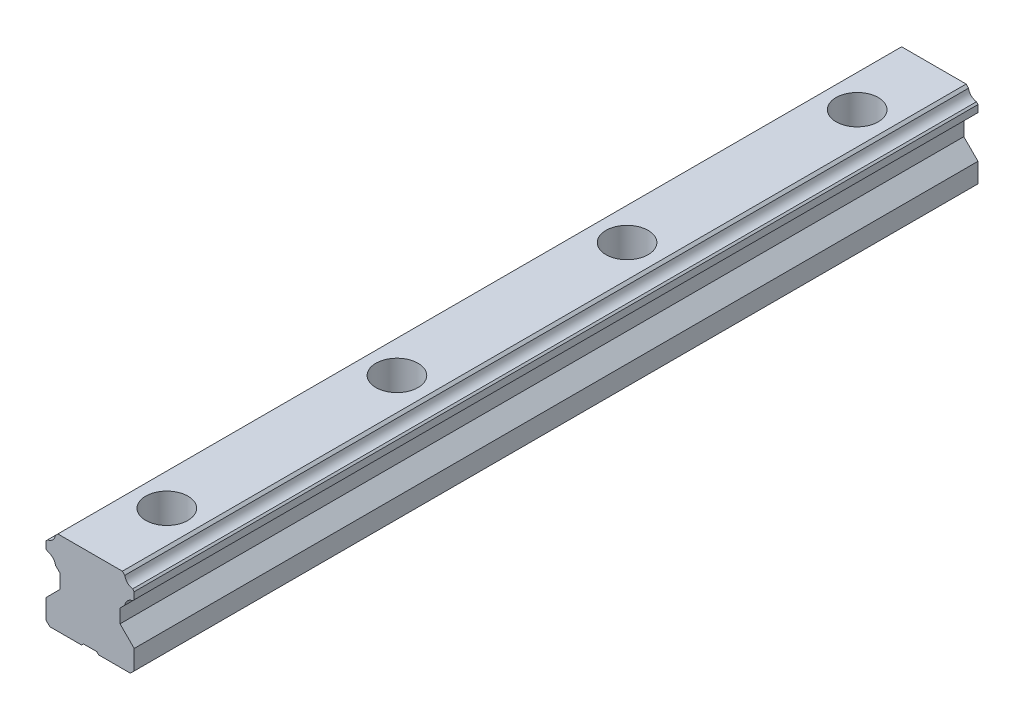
ISO-10303-21;
HEADER;
FILE_DESCRIPTION(('STEP AP214'),'2;1');
FILE_NAME('part.step','',(''),(''),'','','');
FILE_SCHEMA(('AUTOMOTIVE_DESIGN { 1 0 10303 214 1 1 1 1 }'));
ENDSEC;
DATA;
#1=APPLICATION_CONTEXT('core data for automotive mechanical design processes');
#2=APPLICATION_PROTOCOL_DEFINITION('international standard','automotive_design',2000,#1);
#3=PRODUCT_CONTEXT('',#1,'mechanical');
#4=PRODUCT('Part','Part','',(#3));
#5=PRODUCT_RELATED_PRODUCT_CATEGORY('part','',(#4));
#6=PRODUCT_DEFINITION_FORMATION('','',#4);
#7=PRODUCT_DEFINITION_CONTEXT('part definition',#1,'design');
#8=PRODUCT_DEFINITION('design','',#6,#7);
#9=PRODUCT_DEFINITION_SHAPE('','',#8);
#10=(LENGTH_UNIT() NAMED_UNIT(*) SI_UNIT(.MILLI.,.METRE.));
#11=(NAMED_UNIT(*) PLANE_ANGLE_UNIT() SI_UNIT($,.RADIAN.));
#12=(NAMED_UNIT(*) SI_UNIT($,.STERADIAN.) SOLID_ANGLE_UNIT());
#13=UNCERTAINTY_MEASURE_WITH_UNIT(LENGTH_MEASURE(1.E-05),#10,'distance_accuracy_value','');
#14=(GEOMETRIC_REPRESENTATION_CONTEXT(3) GLOBAL_UNCERTAINTY_ASSIGNED_CONTEXT((#13)) GLOBAL_UNIT_ASSIGNED_CONTEXT((#10,
#11,#12)) REPRESENTATION_CONTEXT('',''));
#15=CARTESIAN_POINT('',(0.,0.,0.));
#16=DIRECTION('',(0.,0.,1.));
#17=DIRECTION('',(1.,0.,0.));
#18=AXIS2_PLACEMENT_3D('',#15,#16,#17);
#19=CARTESIAN_POINT('',(-8.410271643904,21.999999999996,110.));
#20=DIRECTION('',(0.,-1.,0.));
#21=DIRECTION('',(0.,0.,-1.));
#22=AXIS2_PLACEMENT_3D('',#19,#20,#21);
#23=PLANE('',#22);
#24=DIRECTION('',(-1.,0.,0.));
#25=VECTOR('',#24,1.);
#26=CARTESIAN_POINT('',(-8.410271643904,21.999999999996,-110.));
#27=LINE('',#26,#25);
#28=CARTESIAN_POINT('',(8.410271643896,21.999999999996,-110.));
#29=VERTEX_POINT('',#28);
#30=CARTESIAN_POINT('',(-8.410271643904,21.999999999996,-110.));
#31=VERTEX_POINT('',#30);
#32=EDGE_CURVE('E672',#29,#31,#27,.T.);
#33=ORIENTED_EDGE('',*,*,#32,.T.);
#34=DIRECTION('',(0.,0.,-1.));
#35=VECTOR('',#34,1.);
#36=CARTESIAN_POINT('',(-8.410271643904,21.999999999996,110.));
#37=LINE('',#36,#35);
#38=CARTESIAN_POINT('',(-8.410271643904,21.999999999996,110.));
#39=VERTEX_POINT('',#38);
#40=EDGE_CURVE('E680',#39,#31,#37,.T.);
#41=ORIENTED_EDGE('',*,*,#40,.F.);
#42=DIRECTION('',(-1.,0.,0.));
#43=VECTOR('',#42,1.);
#44=CARTESIAN_POINT('',(-8.410271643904,21.999999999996,110.));
#45=LINE('',#44,#43);
#46=CARTESIAN_POINT('',(8.410271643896,21.999999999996,110.));
#47=VERTEX_POINT('',#46);
#48=EDGE_CURVE('E754',#47,#39,#45,.T.);
#49=ORIENTED_EDGE('',*,*,#48,.F.);
#50=DIRECTION('',(0.,0.,-1.));
#51=VECTOR('',#50,1.);
#52=CARTESIAN_POINT('',(8.410271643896,21.999999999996,110.));
#53=LINE('',#52,#51);
#54=EDGE_CURVE('E684',#47,#29,#53,.T.);
#55=ORIENTED_EDGE('',*,*,#54,.T.);
#56=EDGE_LOOP('',(#33,#41,#49,#55));
#57=FACE_BOUND('',#56,.T.);
#58=CARTESIAN_POINT('',(0.,21.999999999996,90.));
#59=DIRECTION('',(0.,1.,0.));
#60=DIRECTION('',(0.,0.,1.));
#61=AXIS2_PLACEMENT_3D('',#58,#59,#60);
#62=CIRCLE('',#61,5.5);
#63=CARTESIAN_POINT('',(0.,21.999999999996,95.5));
#64=VERTEX_POINT('',#63);
#65=EDGE_CURVE('E432',#64,#64,#62,.T.);
#66=ORIENTED_EDGE('',*,*,#65,.F.);
#67=EDGE_LOOP('',(#66));
#68=FACE_BOUND('',#67,.T.);
#69=CARTESIAN_POINT('',(0.,21.999999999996,30.));
#70=DIRECTION('',(0.,1.,0.));
#71=DIRECTION('',(0.,0.,1.));
#72=AXIS2_PLACEMENT_3D('',#69,#70,#71);
#73=CIRCLE('',#72,5.5);
#74=CARTESIAN_POINT('',(0.,21.999999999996,35.5));
#75=VERTEX_POINT('',#74);
#76=EDGE_CURVE('E451',#75,#75,#73,.T.);
#77=ORIENTED_EDGE('',*,*,#76,.F.);
#78=EDGE_LOOP('',(#77));
#79=FACE_BOUND('',#78,.T.);
#80=CARTESIAN_POINT('',(0.,21.999999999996,-30.));
#81=DIRECTION('',(0.,1.,0.));
#82=DIRECTION('',(0.,0.,1.));
#83=AXIS2_PLACEMENT_3D('',#80,#81,#82);
#84=CIRCLE('',#83,5.5);
#85=CARTESIAN_POINT('',(0.,21.999999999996,-24.5));
#86=VERTEX_POINT('',#85);
#87=EDGE_CURVE('E472',#86,#86,#84,.T.);
#88=ORIENTED_EDGE('',*,*,#87,.F.);
#89=EDGE_LOOP('',(#88));
#90=FACE_BOUND('',#89,.T.);
#91=CARTESIAN_POINT('',(0.,21.999999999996,-90.));
#92=DIRECTION('',(0.,1.,0.));
#93=DIRECTION('',(0.,0.,1.));
#94=AXIS2_PLACEMENT_3D('',#91,#92,#93);
#95=CIRCLE('',#94,5.5);
#96=CARTESIAN_POINT('',(0.,21.999999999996,-84.5));
#97=VERTEX_POINT('',#96);
#98=EDGE_CURVE('E487',#97,#97,#95,.T.);
#99=ORIENTED_EDGE('',*,*,#98,.F.);
#100=EDGE_LOOP('',(#99));
#101=FACE_BOUND('',#100,.T.);
#102=ADVANCED_FACE('F35',(#57,#68,#79,#90,#101),#23,.F.);
#103=CARTESIAN_POINT('',(-1.75,0.5,110.));
#104=DIRECTION('',(0.,1.,0.));
#105=DIRECTION('',(0.,0.,1.));
#106=AXIS2_PLACEMENT_3D('',#103,#104,#105);
#107=PLANE('',#106);
#108=DIRECTION('',(0.,0.,-1.));
#109=VECTOR('',#108,1.);
#110=CARTESIAN_POINT('',(1.75,0.5,110.));
#111=LINE('',#110,#109);
#112=CARTESIAN_POINT('',(1.75,0.5,-93.0310889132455));
#113=VERTEX_POINT('',#112);
#114=CARTESIAN_POINT('',(1.75,0.5,-110.));
#115=VERTEX_POINT('',#114);
#116=EDGE_CURVE('E340',#113,#115,#111,.T.);
#117=ORIENTED_EDGE('',*,*,#116,.F.);
#118=CARTESIAN_POINT('',(0.,0.5,-90.));
#119=DIRECTION('',(0.,1.,0.));
#120=DIRECTION('',(0.,0.,1.));
#121=AXIS2_PLACEMENT_3D('',#118,#119,#120);
#122=CIRCLE('',#121,3.5);
#123=CARTESIAN_POINT('',(-1.75,0.5,-93.0310889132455));
#124=VERTEX_POINT('',#123);
#125=EDGE_CURVE('E318',#113,#124,#122,.T.);
#126=ORIENTED_EDGE('',*,*,#125,.T.);
#127=DIRECTION('',(0.,0.,-1.));
#128=VECTOR('',#127,1.);
#129=CARTESIAN_POINT('',(-1.75,0.5,110.));
#130=LINE('',#129,#128);
#131=CARTESIAN_POINT('',(-1.75,0.5,-110.));
#132=VERTEX_POINT('',#131);
#133=EDGE_CURVE('E345',#124,#132,#130,.T.);
#134=ORIENTED_EDGE('',*,*,#133,.T.);
#135=DIRECTION('',(1.,0.,0.));
#136=VECTOR('',#135,1.);
#137=CARTESIAN_POINT('',(-1.75,0.5,-110.));
#138=LINE('',#137,#136);
#139=EDGE_CURVE('E410',#132,#115,#138,.T.);
#140=ORIENTED_EDGE('',*,*,#139,.T.);
#141=EDGE_LOOP('',(#117,#126,#134,#140));
#142=FACE_BOUND('',#141,.T.);
#143=ADVANCED_FACE('F407',(#142),#107,.F.);
#144=CARTESIAN_POINT('',(-1.75,0.5,110.));
#145=DIRECTION('',(-0.707106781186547,0.707106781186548,0.));
#146=DIRECTION('',(-0.707106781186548,-0.707106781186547,0.));
#147=AXIS2_PLACEMENT_3D('',#144,#145,#146);
#148=PLANE('',#147);
#149=ORIENTED_EDGE('',*,*,#133,.F.);
#150=CARTESIAN_POINT('',(0.,2.25,-90.));
#151=DIRECTION('',(-0.707106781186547,0.707106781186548,0.));
#152=DIRECTION('',(0.707106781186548,0.707106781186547,0.));
#153=AXIS2_PLACEMENT_3D('',#150,#151,#152);
#154=ELLIPSE('',#153,4.94974746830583,3.5);
#155=CARTESIAN_POINT('',(-2.25,0.,-92.6809513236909));
#156=VERTEX_POINT('',#155);
#157=EDGE_CURVE('E476',#124,#156,#154,.T.);
#158=ORIENTED_EDGE('',*,*,#157,.T.);
#159=DIRECTION('',(0.,0.,-1.));
#160=VECTOR('',#159,1.);
#161=CARTESIAN_POINT('',(-2.25,0.,110.));
#162=LINE('',#161,#160);
#163=CARTESIAN_POINT('',(-2.25,0.,-110.));
#164=VERTEX_POINT('',#163);
#165=EDGE_CURVE('E350',#156,#164,#162,.T.);
#166=ORIENTED_EDGE('',*,*,#165,.T.);
#167=DIRECTION('',(0.707106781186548,0.707106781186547,0.));
#168=VECTOR('',#167,1.);
#169=CARTESIAN_POINT('',(-1.75,0.5,-110.));
#170=LINE('',#169,#168);
#171=EDGE_CURVE('E642',#164,#132,#170,.T.);
#172=ORIENTED_EDGE('',*,*,#171,.T.);
#173=EDGE_LOOP('',(#149,#158,#166,#172));
#174=FACE_BOUND('',#173,.T.);
#175=ADVANCED_FACE('F499',(#174),#148,.F.);
#176=CARTESIAN_POINT('',(2.25,0.,110.));
#177=DIRECTION('',(0.707106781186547,0.707106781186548,0.));
#178=DIRECTION('',(-0.707106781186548,0.707106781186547,0.));
#179=AXIS2_PLACEMENT_3D('',#176,#177,#178);
#180=PLANE('',#179);
#181=CARTESIAN_POINT('',(1.75,0.5,-33.0310889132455));
#182=VERTEX_POINT('',#181);
#183=CARTESIAN_POINT('',(1.75,0.5,-86.9689110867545));
#184=VERTEX_POINT('',#183);
#185=EDGE_CURVE('E327',#182,#184,#111,.T.);
#186=ORIENTED_EDGE('',*,*,#185,.T.);
#187=CARTESIAN_POINT('',(0.,2.25,-90.));
#188=DIRECTION('',(0.707106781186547,0.707106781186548,0.));
#189=DIRECTION('',(-0.707106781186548,0.707106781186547,0.));
#190=AXIS2_PLACEMENT_3D('',#187,#188,#189);
#191=ELLIPSE('',#190,4.94974746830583,3.5);
#192=CARTESIAN_POINT('',(2.25,0.,-87.3190486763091));
#193=VERTEX_POINT('',#192);
#194=EDGE_CURVE('E11',#184,#193,#191,.T.);
#195=ORIENTED_EDGE('',*,*,#194,.T.);
#196=DIRECTION('',(0.,0.,-1.));
#197=VECTOR('',#196,1.);
#198=CARTESIAN_POINT('',(2.25,0.,110.));
#199=LINE('',#198,#197);
#200=CARTESIAN_POINT('',(2.25,0.,-32.6809513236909));
#201=VERTEX_POINT('',#200);
#202=EDGE_CURVE('E325',#201,#193,#199,.T.);
#203=ORIENTED_EDGE('',*,*,#202,.F.);
#204=CARTESIAN_POINT('',(0.,2.25,-30.));
#205=DIRECTION('',(0.707106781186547,0.707106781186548,0.));
#206=DIRECTION('',(-0.707106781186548,0.707106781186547,0.));
#207=AXIS2_PLACEMENT_3D('',#204,#205,#206);
#208=ELLIPSE('',#207,4.94974746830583,3.5);
#209=EDGE_CURVE('E57',#201,#182,#208,.T.);
#210=ORIENTED_EDGE('',*,*,#209,.T.);
#211=EDGE_LOOP('',(#186,#195,#203,#210));
#212=FACE_BOUND('',#211,.T.);
#213=ADVANCED_FACE('F324',(#212),#180,.F.);
#214=CARTESIAN_POINT('',(-1.75,0.5,-33.0310889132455));
#215=VERTEX_POINT('',#214);
#216=CARTESIAN_POINT('',(-1.75,0.5,-86.9689110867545));
#217=VERTEX_POINT('',#216);
#218=EDGE_CURVE('E1262',#215,#217,#130,.T.);
#219=ORIENTED_EDGE('',*,*,#218,.T.);
#220=EDGE_CURVE('E479',#217,#184,#122,.T.);
#221=ORIENTED_EDGE('',*,*,#220,.T.);
#222=ORIENTED_EDGE('',*,*,#185,.F.);
#223=CARTESIAN_POINT('',(0.,0.5,-30.));
#224=DIRECTION('',(0.,1.,0.));
#225=DIRECTION('',(0.,0.,1.));
#226=AXIS2_PLACEMENT_3D('',#223,#224,#225);
#227=CIRCLE('',#226,3.5);
#228=EDGE_CURVE('E459',#182,#215,#227,.T.);
#229=ORIENTED_EDGE('',*,*,#228,.T.);
#230=EDGE_LOOP('',(#219,#221,#222,#229));
#231=FACE_BOUND('',#230,.T.);
#232=ADVANCED_FACE('F501',(#231),#107,.F.);
#233=CARTESIAN_POINT('',(-2.25,0.,-32.6809513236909));
#234=VERTEX_POINT('',#233);
#235=CARTESIAN_POINT('',(-2.25,0.,-87.3190486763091));
#236=VERTEX_POINT('',#235);
#237=EDGE_CURVE('E1234',#234,#236,#162,.T.);
#238=ORIENTED_EDGE('',*,*,#237,.T.);
#239=EDGE_CURVE('E475',#236,#217,#154,.T.);
#240=ORIENTED_EDGE('',*,*,#239,.T.);
#241=ORIENTED_EDGE('',*,*,#218,.F.);
#242=CARTESIAN_POINT('',(0.,2.25,-30.));
#243=DIRECTION('',(-0.707106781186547,0.707106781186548,0.));
#244=DIRECTION('',(0.707106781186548,0.707106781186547,0.));
#245=AXIS2_PLACEMENT_3D('',#242,#243,#244);
#246=ELLIPSE('',#245,4.94974746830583,3.5);
#247=EDGE_CURVE('E455',#215,#234,#246,.T.);
#248=ORIENTED_EDGE('',*,*,#247,.T.);
#249=EDGE_LOOP('',(#238,#240,#241,#248));
#250=FACE_BOUND('',#249,.T.);
#251=ADVANCED_FACE('F936',(#250),#148,.F.);
#252=CARTESIAN_POINT('',(1.75,0.5,26.9689110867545));
#253=VERTEX_POINT('',#252);
#254=CARTESIAN_POINT('',(1.75,0.5,-26.9689110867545));
#255=VERTEX_POINT('',#254);
#256=EDGE_CURVE('E412',#253,#255,#111,.T.);
#257=ORIENTED_EDGE('',*,*,#256,.T.);
#258=CARTESIAN_POINT('',(2.25,0.,-27.3190486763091));
#259=VERTEX_POINT('',#258);
#260=EDGE_CURVE('E458',#255,#259,#208,.T.);
#261=ORIENTED_EDGE('',*,*,#260,.T.);
#262=CARTESIAN_POINT('',(2.25,0.,27.3190486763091));
#263=VERTEX_POINT('',#262);
#264=EDGE_CURVE('E331',#263,#259,#199,.T.);
#265=ORIENTED_EDGE('',*,*,#264,.F.);
#266=CARTESIAN_POINT('',(0.,2.25,30.));
#267=DIRECTION('',(0.707106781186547,0.707106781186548,0.));
#268=DIRECTION('',(-0.707106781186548,0.707106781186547,0.));
#269=AXIS2_PLACEMENT_3D('',#266,#267,#268);
#270=ELLIPSE('',#269,4.94974746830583,3.5);
#271=EDGE_CURVE('E388',#263,#253,#270,.T.);
#272=ORIENTED_EDGE('',*,*,#271,.T.);
#273=EDGE_LOOP('',(#257,#261,#265,#272));
#274=FACE_BOUND('',#273,.T.);
#275=ADVANCED_FACE('F943',(#274),#180,.F.);
#276=CARTESIAN_POINT('',(-2.25,0.,27.3190486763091));
#277=VERTEX_POINT('',#276);
#278=CARTESIAN_POINT('',(-2.25,0.,-27.3190486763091));
#279=VERTEX_POINT('',#278);
#280=EDGE_CURVE('E1232',#277,#279,#162,.T.);
#281=ORIENTED_EDGE('',*,*,#280,.T.);
#282=CARTESIAN_POINT('',(-1.75,0.5,-26.9689110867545));
#283=VERTEX_POINT('',#282);
#284=EDGE_CURVE('E454',#279,#283,#246,.T.);
#285=ORIENTED_EDGE('',*,*,#284,.T.);
#286=CARTESIAN_POINT('',(-1.75,0.5,26.9689110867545));
#287=VERTEX_POINT('',#286);
#288=EDGE_CURVE('E1263',#287,#283,#130,.T.);
#289=ORIENTED_EDGE('',*,*,#288,.F.);
#290=CARTESIAN_POINT('',(0.,2.25,30.));
#291=DIRECTION('',(-0.707106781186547,0.707106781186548,0.));
#292=DIRECTION('',(0.707106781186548,0.707106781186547,0.));
#293=AXIS2_PLACEMENT_3D('',#290,#291,#292);
#294=ELLIPSE('',#293,4.94974746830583,3.5);
#295=EDGE_CURVE('E429',#287,#277,#294,.T.);
#296=ORIENTED_EDGE('',*,*,#295,.T.);
#297=EDGE_LOOP('',(#281,#285,#289,#296));
#298=FACE_BOUND('',#297,.T.);
#299=ADVANCED_FACE('F959',(#298),#148,.F.);
#300=ORIENTED_EDGE('',*,*,#288,.T.);
#301=EDGE_CURVE('E462',#283,#255,#227,.T.);
#302=ORIENTED_EDGE('',*,*,#301,.T.);
#303=ORIENTED_EDGE('',*,*,#256,.F.);
#304=CARTESIAN_POINT('',(0.,0.5,30.));
#305=DIRECTION('',(0.,1.,0.));
#306=DIRECTION('',(0.,0.,1.));
#307=AXIS2_PLACEMENT_3D('',#304,#305,#306);
#308=CIRCLE('',#307,3.5);
#309=EDGE_CURVE('E431',#253,#287,#308,.T.);
#310=ORIENTED_EDGE('',*,*,#309,.T.);
#311=EDGE_LOOP('',(#300,#302,#303,#310));
#312=FACE_BOUND('',#311,.T.);
#313=ADVANCED_FACE('F951',(#312),#107,.F.);
#314=CARTESIAN_POINT('',(1.75,0.5,86.9689110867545));
#315=VERTEX_POINT('',#314);
#316=CARTESIAN_POINT('',(1.75,0.5,33.0310889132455));
#317=VERTEX_POINT('',#316);
#318=EDGE_CURVE('E346',#315,#317,#111,.T.);
#319=ORIENTED_EDGE('',*,*,#318,.T.);
#320=CARTESIAN_POINT('',(2.25,0.,32.6809513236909));
#321=VERTEX_POINT('',#320);
#322=EDGE_CURVE('E390',#317,#321,#270,.T.);
#323=ORIENTED_EDGE('',*,*,#322,.T.);
#324=CARTESIAN_POINT('',(2.25,0.,87.3190486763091));
#325=VERTEX_POINT('',#324);
#326=EDGE_CURVE('E334',#325,#321,#199,.T.);
#327=ORIENTED_EDGE('',*,*,#326,.F.);
#328=CARTESIAN_POINT('',(0.,2.25,90.));
#329=DIRECTION('',(0.707106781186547,0.707106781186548,0.));
#330=DIRECTION('',(-0.707106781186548,0.707106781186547,0.));
#331=AXIS2_PLACEMENT_3D('',#328,#329,#330);
#332=ELLIPSE('',#331,4.94974746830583,3.5);
#333=EDGE_CURVE('E417',#325,#315,#332,.T.);
#334=ORIENTED_EDGE('',*,*,#333,.T.);
#335=EDGE_LOOP('',(#319,#323,#327,#334));
#336=FACE_BOUND('',#335,.T.);
#337=ADVANCED_FACE('F416',(#336),#180,.F.);
#338=CARTESIAN_POINT('',(-2.25,0.,87.3190486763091));
#339=VERTEX_POINT('',#338);
#340=CARTESIAN_POINT('',(-2.25,0.,32.6809513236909));
#341=VERTEX_POINT('',#340);
#342=EDGE_CURVE('E356',#339,#341,#162,.T.);
#343=ORIENTED_EDGE('',*,*,#342,.T.);
#344=CARTESIAN_POINT('',(-1.75,0.5,33.0310889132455));
#345=VERTEX_POINT('',#344);
#346=EDGE_CURVE('E428',#341,#345,#294,.T.);
#347=ORIENTED_EDGE('',*,*,#346,.T.);
#348=CARTESIAN_POINT('',(-1.75,0.5,86.9689110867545));
#349=VERTEX_POINT('',#348);
#350=EDGE_CURVE('E351',#349,#345,#130,.T.);
#351=ORIENTED_EDGE('',*,*,#350,.F.);
#352=CARTESIAN_POINT('',(0.,2.25,90.));
#353=DIRECTION('',(-0.707106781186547,0.707106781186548,0.));
#354=DIRECTION('',(0.707106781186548,0.707106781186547,0.));
#355=AXIS2_PLACEMENT_3D('',#352,#353,#354);
#356=ELLIPSE('',#355,4.94974746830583,3.5);
#357=EDGE_CURVE('E760',#349,#339,#356,.T.);
#358=ORIENTED_EDGE('',*,*,#357,.T.);
#359=EDGE_LOOP('',(#343,#347,#351,#358));
#360=FACE_BOUND('',#359,.T.);
#361=ADVANCED_FACE('F564',(#360),#148,.F.);
#362=ORIENTED_EDGE('',*,*,#350,.T.);
#363=EDGE_CURVE('E425',#345,#317,#308,.T.);
#364=ORIENTED_EDGE('',*,*,#363,.T.);
#365=ORIENTED_EDGE('',*,*,#318,.F.);
#366=CARTESIAN_POINT('',(0.,0.5,90.));
#367=DIRECTION('',(0.,1.,0.));
#368=DIRECTION('',(0.,0.,1.));
#369=AXIS2_PLACEMENT_3D('',#366,#367,#368);
#370=CIRCLE('',#369,3.5);
#371=EDGE_CURVE('E423',#315,#349,#370,.T.);
#372=ORIENTED_EDGE('',*,*,#371,.T.);
#373=EDGE_LOOP('',(#362,#364,#365,#372));
#374=FACE_BOUND('',#373,.T.);
#375=ADVANCED_FACE('F422',(#374),#107,.F.);
#376=CARTESIAN_POINT('',(1.75,0.5,110.));
#377=VERTEX_POINT('',#376);
#378=CARTESIAN_POINT('',(1.75,0.5,93.0310889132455));
#379=VERTEX_POINT('',#378);
#380=EDGE_CURVE('E342',#377,#379,#111,.T.);
#381=ORIENTED_EDGE('',*,*,#380,.T.);
#382=CARTESIAN_POINT('',(2.25,0.,92.6809513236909));
#383=VERTEX_POINT('',#382);
#384=EDGE_CURVE('E763',#379,#383,#332,.T.);
#385=ORIENTED_EDGE('',*,*,#384,.T.);
#386=CARTESIAN_POINT('',(2.25,0.,110.));
#387=VERTEX_POINT('',#386);
#388=EDGE_CURVE('E336',#387,#383,#199,.T.);
#389=ORIENTED_EDGE('',*,*,#388,.F.);
#390=DIRECTION('',(0.707106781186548,-0.707106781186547,0.));
#391=VECTOR('',#390,1.);
#392=CARTESIAN_POINT('',(2.25,0.,110.));
#393=LINE('',#392,#391);
#394=EDGE_CURVE('E1217',#377,#387,#393,.T.);
#395=ORIENTED_EDGE('',*,*,#394,.F.);
#396=EDGE_LOOP('',(#381,#385,#389,#395));
#397=FACE_BOUND('',#396,.T.);
#398=ADVANCED_FACE('F555',(#397),#180,.F.);
#399=CARTESIAN_POINT('',(-11.482666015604,21.777832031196,110.));
#400=DIRECTION('',(0.,0.,-1.));
#401=DIRECTION('',(-1.,0.,0.));
#402=AXIS2_PLACEMENT_3D('',#399,#400,#401);
#403=CYLINDRICAL_SURFACE('',#402,2.47999954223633);
#404=CARTESIAN_POINT('',(-11.482666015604,21.777832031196,-110.));
#405=DIRECTION('',(0.,0.,-1.));
#406=DIRECTION('',(1.,0.,0.));
#407=AXIS2_PLACEMENT_3D('',#404,#405,#406);
#408=CIRCLE('',#407,2.47999954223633);
#409=CARTESIAN_POINT('',(-9.03566651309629,21.3746060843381,-110.));
#410=VERTEX_POINT('',#409);
#411=CARTESIAN_POINT('',(-11.0794400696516,19.3308325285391,-110.));
#412=VERTEX_POINT('',#411);
#413=EDGE_CURVE('E615',#410,#412,#408,.T.);
#414=ORIENTED_EDGE('',*,*,#413,.T.);
#415=DIRECTION('',(0.,0.,-1.));
#416=VECTOR('',#415,1.);
#417=CARTESIAN_POINT('',(-11.0794400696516,19.3308325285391,110.));
#418=LINE('',#417,#416);
#419=CARTESIAN_POINT('',(-11.0794400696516,19.3308325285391,110.));
#420=VERTEX_POINT('',#419);
#421=EDGE_CURVE('E383',#420,#412,#418,.T.);
#422=ORIENTED_EDGE('',*,*,#421,.F.);
#423=CARTESIAN_POINT('',(-11.482666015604,21.777832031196,110.));
#424=DIRECTION('',(0.,0.,-1.));
#425=DIRECTION('',(1.,0.,0.));
#426=AXIS2_PLACEMENT_3D('',#423,#424,#425);
#427=CIRCLE('',#426,2.47999954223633);
#428=CARTESIAN_POINT('',(-9.03566651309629,21.3746060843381,110.));
#429=VERTEX_POINT('',#428);
#430=EDGE_CURVE('E676',#429,#420,#427,.T.);
#431=ORIENTED_EDGE('',*,*,#430,.F.);
#432=DIRECTION('',(0.,0.,-1.));
#433=VECTOR('',#432,1.);
#434=CARTESIAN_POINT('',(-9.03566651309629,21.3746060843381,110.));
#435=LINE('',#434,#433);
#436=EDGE_CURVE('E677',#429,#410,#435,.T.);
#437=ORIENTED_EDGE('',*,*,#436,.T.);
#438=EDGE_LOOP('',(#414,#422,#431,#437));
#439=FACE_BOUND('',#438,.T.);
#440=ADVANCED_FACE('F37',(#439),#403,.F.);
#441=CARTESIAN_POINT('',(-11.500000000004,18.910271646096,110.));
#442=DIRECTION('',(0.70710758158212,-0.707105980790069,0.));
#443=DIRECTION('',(0.707105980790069,0.70710758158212,0.));
#444=AXIS2_PLACEMENT_3D('',#441,#442,#443);
#445=PLANE('',#444);
#446=DIRECTION('',(-0.707105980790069,-0.70710758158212,0.));
#447=VECTOR('',#446,1.);
#448=CARTESIAN_POINT('',(-11.500000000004,18.910271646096,-110.));
#449=LINE('',#448,#447);
#450=CARTESIAN_POINT('',(-11.500000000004,18.910271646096,-110.));
#451=VERTEX_POINT('',#450);
#452=EDGE_CURVE('E607',#412,#451,#449,.T.);
#453=ORIENTED_EDGE('',*,*,#452,.T.);
#454=DIRECTION('',(0.,0.,-1.));
#455=VECTOR('',#454,1.);
#456=CARTESIAN_POINT('',(-11.500000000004,18.910271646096,110.));
#457=LINE('',#456,#455);
#458=CARTESIAN_POINT('',(-11.500000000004,18.910271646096,110.));
#459=VERTEX_POINT('',#458);
#460=EDGE_CURVE('E380',#459,#451,#457,.T.);
#461=ORIENTED_EDGE('',*,*,#460,.F.);
#462=DIRECTION('',(-0.707105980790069,-0.70710758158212,0.));
#463=VECTOR('',#462,1.);
#464=CARTESIAN_POINT('',(-11.500000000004,18.910271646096,110.));
#465=LINE('',#464,#463);
#466=EDGE_CURVE('E1193',#420,#459,#465,.T.);
#467=ORIENTED_EDGE('',*,*,#466,.F.);
#468=ORIENTED_EDGE('',*,*,#421,.T.);
#469=EDGE_LOOP('',(#453,#461,#467,#468));
#470=FACE_BOUND('',#469,.T.);
#471=ADVANCED_FACE('F598',(#470),#445,.F.);
#472=CARTESIAN_POINT('',(-11.500000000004,18.910271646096,110.));
#473=DIRECTION('',(1.,0.,0.));
#474=DIRECTION('',(0.,0.,-1.));
#475=AXIS2_PLACEMENT_3D('',#472,#473,#474);
#476=PLANE('',#475);
#477=DIRECTION('',(0.,-1.,0.));
#478=VECTOR('',#477,1.);
#479=CARTESIAN_POINT('',(-11.500000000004,18.910271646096,-110.));
#480=LINE('',#479,#478);
#481=CARTESIAN_POINT('',(-11.500000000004,17.079302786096,-110.));
#482=VERTEX_POINT('',#481);
#483=EDGE_CURVE('E614',#451,#482,#480,.T.);
#484=ORIENTED_EDGE('',*,*,#483,.T.);
#485=DIRECTION('',(0.,0.,-1.));
#486=VECTOR('',#485,1.);
#487=CARTESIAN_POINT('',(-11.500000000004,17.079302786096,110.));
#488=LINE('',#487,#486);
#489=CARTESIAN_POINT('',(-11.500000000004,17.079302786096,110.));
#490=VERTEX_POINT('',#489);
#491=EDGE_CURVE('E377',#490,#482,#488,.T.);
#492=ORIENTED_EDGE('',*,*,#491,.F.);
#493=DIRECTION('',(0.,-1.,0.));
#494=VECTOR('',#493,1.);
#495=CARTESIAN_POINT('',(-11.500000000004,18.910271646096,110.));
#496=LINE('',#495,#494);
#497=EDGE_CURVE('E618',#459,#490,#496,.T.);
#498=ORIENTED_EDGE('',*,*,#497,.F.);
#499=ORIENTED_EDGE('',*,*,#460,.T.);
#500=EDGE_LOOP('',(#484,#492,#498,#499));
#501=FACE_BOUND('',#500,.T.);
#502=ADVANCED_FACE('F595',(#501),#476,.F.);
#503=CARTESIAN_POINT('',(-11.0915942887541,16.6708951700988,110.));
#504=DIRECTION('',(0.707108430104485,0.707105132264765,0.));
#505=DIRECTION('',(-0.707105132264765,0.707108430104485,0.));
#506=AXIS2_PLACEMENT_3D('',#503,#504,#505);
#507=PLANE('',#506);
#508=DIRECTION('',(0.707105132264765,-0.707108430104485,0.));
#509=VECTOR('',#508,1.);
#510=CARTESIAN_POINT('',(-11.0915942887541,16.6708951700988,-110.));
#511=LINE('',#510,#509);
#512=CARTESIAN_POINT('',(-11.0915942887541,16.6708951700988,-110.));
#513=VERTEX_POINT('',#512);
#514=EDGE_CURVE('E622',#482,#513,#511,.T.);
#515=ORIENTED_EDGE('',*,*,#514,.T.);
#516=DIRECTION('',(0.,0.,-1.));
#517=VECTOR('',#516,1.);
#518=CARTESIAN_POINT('',(-11.0915942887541,16.6708951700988,110.));
#519=LINE('',#518,#517);
#520=CARTESIAN_POINT('',(-11.0915942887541,16.6708951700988,110.));
#521=VERTEX_POINT('',#520);
#522=EDGE_CURVE('E374',#521,#513,#519,.T.);
#523=ORIENTED_EDGE('',*,*,#522,.F.);
#524=DIRECTION('',(0.707105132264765,-0.707108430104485,0.));
#525=VECTOR('',#524,1.);
#526=CARTESIAN_POINT('',(-11.0915942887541,16.6708951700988,110.));
#527=LINE('',#526,#525);
#528=EDGE_CURVE('E1197',#490,#521,#527,.T.);
#529=ORIENTED_EDGE('',*,*,#528,.F.);
#530=ORIENTED_EDGE('',*,*,#491,.T.);
#531=EDGE_LOOP('',(#515,#523,#529,#530));
#532=FACE_BOUND('',#531,.T.);
#533=ADVANCED_FACE('F591',(#532),#507,.F.);
#534=CARTESIAN_POINT('',(-11.482666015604,14.221923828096,110.));
#535=DIRECTION('',(0.,0.,-1.));
#536=DIRECTION('',(-1.,0.,0.));
#537=AXIS2_PLACEMENT_3D('',#534,#535,#536);
#538=CYLINDRICAL_SURFACE('',#537,2.47999954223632);
#539=CARTESIAN_POINT('',(-11.482666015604,14.221923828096,-110.));
#540=DIRECTION('',(0.,0.,-1.));
#541=DIRECTION('',(1.,0.,0.));
#542=AXIS2_PLACEMENT_3D('',#539,#540,#541);
#543=CIRCLE('',#542,2.47999954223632);
#544=CARTESIAN_POINT('',(-9.03369485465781,14.6129966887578,-110.));
#545=VERTEX_POINT('',#544);
#546=EDGE_CURVE('E624',#513,#545,#543,.T.);
#547=ORIENTED_EDGE('',*,*,#546,.T.);
#548=DIRECTION('',(0.,0.,-1.));
#549=VECTOR('',#548,1.);
#550=CARTESIAN_POINT('',(-9.03369485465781,14.6129966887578,110.));
#551=LINE('',#550,#549);
#552=CARTESIAN_POINT('',(-9.03369485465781,14.6129966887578,110.));
#553=VERTEX_POINT('',#552);
#554=EDGE_CURVE('E371',#553,#545,#551,.T.);
#555=ORIENTED_EDGE('',*,*,#554,.F.);
#556=CARTESIAN_POINT('',(-11.482666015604,14.221923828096,110.));
#557=DIRECTION('',(0.,0.,-1.));
#558=DIRECTION('',(1.,0.,0.));
#559=AXIS2_PLACEMENT_3D('',#556,#557,#558);
#560=CIRCLE('',#559,2.47999954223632);
#561=EDGE_CURVE('E1199',#521,#553,#560,.T.);
#562=ORIENTED_EDGE('',*,*,#561,.F.);
#563=ORIENTED_EDGE('',*,*,#522,.T.);
#564=EDGE_LOOP('',(#547,#555,#562,#563));
#565=FACE_BOUND('',#564,.T.);
#566=ADVANCED_FACE('F587',(#565),#538,.F.);
#567=CARTESIAN_POINT('',(-9.03369485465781,14.6129966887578,110.));
#568=DIRECTION('',(0.707106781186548,0.707106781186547,0.));
#569=DIRECTION('',(-0.707106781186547,0.707106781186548,0.));
#570=AXIS2_PLACEMENT_3D('',#567,#568,#569);
#571=PLANE('',#570);
#572=DIRECTION('',(0.707106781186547,-0.707106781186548,0.));
#573=VECTOR('',#572,1.);
#574=CARTESIAN_POINT('',(-9.03369485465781,14.6129966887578,-110.));
#575=LINE('',#574,#573);
#576=CARTESIAN_POINT('',(-7.8000488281,13.3793506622,-110.));
#577=VERTEX_POINT('',#576);
#578=EDGE_CURVE('E629',#545,#577,#575,.T.);
#579=ORIENTED_EDGE('',*,*,#578,.T.);
#580=DIRECTION('',(0.,0.,-1.));
#581=VECTOR('',#580,1.);
#582=CARTESIAN_POINT('',(-7.8000488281,13.3793506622,110.));
#583=LINE('',#582,#581);
#584=CARTESIAN_POINT('',(-7.8000488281,13.3793506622,110.));
#585=VERTEX_POINT('',#584);
#586=EDGE_CURVE('E368',#585,#577,#583,.T.);
#587=ORIENTED_EDGE('',*,*,#586,.F.);
#588=DIRECTION('',(0.707106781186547,-0.707106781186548,0.));
#589=VECTOR('',#588,1.);
#590=CARTESIAN_POINT('',(-9.03369485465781,14.6129966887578,110.));
#591=LINE('',#590,#589);
#592=EDGE_CURVE('E1201',#553,#585,#591,.T.);
#593=ORIENTED_EDGE('',*,*,#592,.F.);
#594=ORIENTED_EDGE('',*,*,#554,.T.);
#595=EDGE_LOOP('',(#579,#587,#593,#594));
#596=FACE_BOUND('',#595,.T.);
#597=ADVANCED_FACE('F583',(#596),#571,.F.);
#598=CARTESIAN_POINT('',(-7.8000488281,13.3793506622,110.));
#599=DIRECTION('',(1.,0.,0.));
#600=DIRECTION('',(0.,0.,-1.));
#601=AXIS2_PLACEMENT_3D('',#598,#599,#600);
#602=PLANE('',#601);
#603=DIRECTION('',(0.,-1.,0.));
#604=VECTOR('',#603,1.);
#605=CARTESIAN_POINT('',(-7.8000488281,13.3793506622,-110.));
#606=LINE('',#605,#604);
#607=CARTESIAN_POINT('',(-7.8000488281,9.8001704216,-110.));
#608=VERTEX_POINT('',#607);
#609=EDGE_CURVE('E631',#577,#608,#606,.T.);
#610=ORIENTED_EDGE('',*,*,#609,.T.);
#611=DIRECTION('',(0.,0.,-1.));
#612=VECTOR('',#611,1.);
#613=CARTESIAN_POINT('',(-7.8000488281,9.8001704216,110.));
#614=LINE('',#613,#612);
#615=CARTESIAN_POINT('',(-7.8000488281,9.8001704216,110.));
#616=VERTEX_POINT('',#615);
#617=EDGE_CURVE('E365',#616,#608,#614,.T.);
#618=ORIENTED_EDGE('',*,*,#617,.F.);
#619=DIRECTION('',(0.,-1.,0.));
#620=VECTOR('',#619,1.);
#621=CARTESIAN_POINT('',(-7.8000488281,13.3793506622,110.));
#622=LINE('',#621,#620);
#623=EDGE_CURVE('E1203',#585,#616,#622,.T.);
#624=ORIENTED_EDGE('',*,*,#623,.F.);
#625=ORIENTED_EDGE('',*,*,#586,.T.);
#626=EDGE_LOOP('',(#610,#618,#624,#625));
#627=FACE_BOUND('',#626,.T.);
#628=ADVANCED_FACE('F579',(#627),#602,.F.);
#629=CARTESIAN_POINT('',(-7.8000488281,9.8001704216,110.));
#630=DIRECTION('',(0.707106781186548,-0.707106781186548,0.));
#631=DIRECTION('',(0.707106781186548,0.707106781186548,0.));
#632=AXIS2_PLACEMENT_3D('',#629,#630,#631);
#633=PLANE('',#632);
#634=DIRECTION('',(-0.707106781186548,-0.707106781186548,0.));
#635=VECTOR('',#634,1.);
#636=CARTESIAN_POINT('',(-7.8000488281,9.8001704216,-110.));
#637=LINE('',#636,#635);
#638=CARTESIAN_POINT('',(-11.5,6.1002192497,-110.));
#639=VERTEX_POINT('',#638);
#640=EDGE_CURVE('E633',#608,#639,#637,.T.);
#641=ORIENTED_EDGE('',*,*,#640,.T.);
#642=DIRECTION('',(0.,0.,-1.));
#643=VECTOR('',#642,1.);
#644=CARTESIAN_POINT('',(-11.5,6.1002192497,110.));
#645=LINE('',#644,#643);
#646=CARTESIAN_POINT('',(-11.5,6.1002192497,110.));
#647=VERTEX_POINT('',#646);
#648=EDGE_CURVE('E362',#647,#639,#645,.T.);
#649=ORIENTED_EDGE('',*,*,#648,.F.);
#650=DIRECTION('',(-0.707106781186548,-0.707106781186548,0.));
#651=VECTOR('',#650,1.);
#652=CARTESIAN_POINT('',(-7.8000488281,9.8001704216,110.));
#653=LINE('',#652,#651);
#654=EDGE_CURVE('E1205',#616,#647,#653,.T.);
#655=ORIENTED_EDGE('',*,*,#654,.F.);
#656=ORIENTED_EDGE('',*,*,#617,.T.);
#657=EDGE_LOOP('',(#641,#649,#655,#656));
#658=FACE_BOUND('',#657,.T.);
#659=ADVANCED_FACE('F575',(#658),#633,.F.);
#660=CARTESIAN_POINT('',(-11.5,6.1002192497,110.));
#661=DIRECTION('',(1.,0.,0.));
#662=DIRECTION('',(0.,0.,-1.));
#663=AXIS2_PLACEMENT_3D('',#660,#661,#662);
#664=PLANE('',#663);
#665=DIRECTION('',(0.,-1.,0.));
#666=VECTOR('',#665,1.);
#667=CARTESIAN_POINT('',(-11.5,6.1002192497,-110.));
#668=LINE('',#667,#666);
#669=CARTESIAN_POINT('',(-11.5,1.,-110.));
#670=VERTEX_POINT('',#669);
#671=EDGE_CURVE('E635',#639,#670,#668,.T.);
#672=ORIENTED_EDGE('',*,*,#671,.T.);
#673=DIRECTION('',(0.,0.,-1.));
#674=VECTOR('',#673,1.);
#675=CARTESIAN_POINT('',(-11.5,1.,110.));
#676=LINE('',#675,#674);
#677=CARTESIAN_POINT('',(-11.5,1.,110.));
#678=VERTEX_POINT('',#677);
#679=EDGE_CURVE('E359',#678,#670,#676,.T.);
#680=ORIENTED_EDGE('',*,*,#679,.F.);
#681=DIRECTION('',(0.,-1.,0.));
#682=VECTOR('',#681,1.);
#683=CARTESIAN_POINT('',(-11.5,6.1002192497,110.));
#684=LINE('',#683,#682);
#685=EDGE_CURVE('E1207',#647,#678,#684,.T.);
#686=ORIENTED_EDGE('',*,*,#685,.F.);
#687=ORIENTED_EDGE('',*,*,#648,.T.);
#688=EDGE_LOOP('',(#672,#680,#686,#687));
#689=FACE_BOUND('',#688,.T.);
#690=ADVANCED_FACE('F571',(#689),#664,.F.);
#691=CARTESIAN_POINT('',(-10.5,0.,110.));
#692=DIRECTION('',(0.707106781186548,0.707106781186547,0.));
#693=DIRECTION('',(-0.707106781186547,0.707106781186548,0.));
#694=AXIS2_PLACEMENT_3D('',#691,#692,#693);
#695=PLANE('',#694);
#696=DIRECTION('',(0.707106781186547,-0.707106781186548,0.));
#697=VECTOR('',#696,1.);
#698=CARTESIAN_POINT('',(-10.5,0.,-110.));
#699=LINE('',#698,#697);
#700=CARTESIAN_POINT('',(-10.5,0.,-110.));
#701=VERTEX_POINT('',#700);
#702=EDGE_CURVE('E637',#670,#701,#699,.T.);
#703=ORIENTED_EDGE('',*,*,#702,.T.);
#704=DIRECTION('',(0.,0.,-1.));
#705=VECTOR('',#704,1.);
#706=CARTESIAN_POINT('',(-10.5,0.,110.));
#707=LINE('',#706,#705);
#708=CARTESIAN_POINT('',(-10.5,0.,110.));
#709=VERTEX_POINT('',#708);
#710=EDGE_CURVE('E355',#709,#701,#707,.T.);
#711=ORIENTED_EDGE('',*,*,#710,.F.);
#712=DIRECTION('',(0.707106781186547,-0.707106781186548,0.));
#713=VECTOR('',#712,1.);
#714=CARTESIAN_POINT('',(-10.5,0.,110.));
#715=LINE('',#714,#713);
#716=EDGE_CURVE('E1209',#678,#709,#715,.T.);
#717=ORIENTED_EDGE('',*,*,#716,.F.);
#718=ORIENTED_EDGE('',*,*,#679,.T.);
#719=EDGE_LOOP('',(#703,#711,#717,#718));
#720=FACE_BOUND('',#719,.T.);
#721=ADVANCED_FACE('F567',(#720),#695,.F.);
#722=CARTESIAN_POINT('',(-10.5,0.,110.));
#723=DIRECTION('',(0.,1.,0.));
#724=DIRECTION('',(0.,0.,1.));
#725=AXIS2_PLACEMENT_3D('',#722,#723,#724);
#726=PLANE('',#725);
#727=ORIENTED_EDGE('',*,*,#165,.F.);
#728=CARTESIAN_POINT('',(0.,0.,-90.));
#729=DIRECTION('',(0.,1.,0.));
#730=DIRECTION('',(0.,0.,1.));
#731=AXIS2_PLACEMENT_3D('',#728,#729,#730);
#732=CIRCLE('',#731,3.49999999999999);
#733=EDGE_CURVE('E319',#156,#236,#732,.T.);
#734=ORIENTED_EDGE('',*,*,#733,.T.);
#735=ORIENTED_EDGE('',*,*,#237,.F.);
#736=CARTESIAN_POINT('',(0.,0.,-30.));
#737=DIRECTION('',(0.,1.,0.));
#738=DIRECTION('',(0.,0.,1.));
#739=AXIS2_PLACEMENT_3D('',#736,#737,#738);
#740=CIRCLE('',#739,3.49999999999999);
#741=EDGE_CURVE('E465',#234,#279,#740,.T.);
#742=ORIENTED_EDGE('',*,*,#741,.T.);
#743=ORIENTED_EDGE('',*,*,#280,.F.);
#744=CARTESIAN_POINT('',(0.,0.,30.));
#745=DIRECTION('',(0.,1.,0.));
#746=DIRECTION('',(0.,0.,1.));
#747=AXIS2_PLACEMENT_3D('',#744,#745,#746);
#748=CIRCLE('',#747,3.49999999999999);
#749=EDGE_CURVE('E442',#277,#341,#748,.T.);
#750=ORIENTED_EDGE('',*,*,#749,.T.);
#751=ORIENTED_EDGE('',*,*,#342,.F.);
#752=CARTESIAN_POINT('',(0.,0.,90.));
#753=DIRECTION('',(0.,1.,0.));
#754=DIRECTION('',(0.,0.,1.));
#755=AXIS2_PLACEMENT_3D('',#752,#753,#754);
#756=CIRCLE('',#755,3.5);
#757=CARTESIAN_POINT('',(-2.25,0.,92.6809513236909));
#758=VERTEX_POINT('',#757);
#759=EDGE_CURVE('E386',#339,#758,#756,.T.);
#760=ORIENTED_EDGE('',*,*,#759,.T.);
#761=CARTESIAN_POINT('',(-2.25,0.,110.));
#762=VERTEX_POINT('',#761);
#763=EDGE_CURVE('E352',#762,#758,#162,.T.);
#764=ORIENTED_EDGE('',*,*,#763,.F.);
#765=DIRECTION('',(1.,0.,0.));
#766=VECTOR('',#765,1.);
#767=CARTESIAN_POINT('',(-10.5,0.,110.));
#768=LINE('',#767,#766);
#769=EDGE_CURVE('E1211',#709,#762,#768,.T.);
#770=ORIENTED_EDGE('',*,*,#769,.F.);
#771=ORIENTED_EDGE('',*,*,#710,.T.);
#772=DIRECTION('',(1.,0.,0.));
#773=VECTOR('',#772,1.);
#774=CARTESIAN_POINT('',(-10.5,0.,-110.));
#775=LINE('',#774,#773);
#776=EDGE_CURVE('E639',#701,#164,#775,.T.);
#777=ORIENTED_EDGE('',*,*,#776,.T.);
#778=EDGE_LOOP('',(#727,#734,#735,#742,#743,#750,#751,#760,#764,#770,#771,#777));
#779=FACE_BOUND('',#778,.T.);
#780=ADVANCED_FACE('F562',(#779),#726,.F.);
#781=ORIENTED_EDGE('',*,*,#763,.T.);
#782=CARTESIAN_POINT('',(-1.75,0.5,93.0310889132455));
#783=VERTEX_POINT('',#782);
#784=EDGE_CURVE('E756',#758,#783,#356,.T.);
#785=ORIENTED_EDGE('',*,*,#784,.T.);
#786=CARTESIAN_POINT('',(-1.75,0.5,110.));
#787=VERTEX_POINT('',#786);
#788=EDGE_CURVE('E347',#787,#783,#130,.T.);
#789=ORIENTED_EDGE('',*,*,#788,.F.);
#790=DIRECTION('',(0.707106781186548,0.707106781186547,0.));
#791=VECTOR('',#790,1.);
#792=CARTESIAN_POINT('',(-1.75,0.5,110.));
#793=LINE('',#792,#791);
#794=EDGE_CURVE('E1213',#762,#787,#793,.T.);
#795=ORIENTED_EDGE('',*,*,#794,.F.);
#796=EDGE_LOOP('',(#781,#785,#789,#795));
#797=FACE_BOUND('',#796,.T.);
#798=ADVANCED_FACE('F558',(#797),#148,.F.);
#799=ORIENTED_EDGE('',*,*,#788,.T.);
#800=EDGE_CURVE('E758',#783,#379,#370,.T.);
#801=ORIENTED_EDGE('',*,*,#800,.T.);
#802=ORIENTED_EDGE('',*,*,#380,.F.);
#803=DIRECTION('',(1.,0.,0.));
#804=VECTOR('',#803,1.);
#805=CARTESIAN_POINT('',(-1.75,0.5,110.));
#806=LINE('',#805,#804);
#807=EDGE_CURVE('E1215',#787,#377,#806,.T.);
#808=ORIENTED_EDGE('',*,*,#807,.F.);
#809=EDGE_LOOP('',(#799,#801,#802,#808));
#810=FACE_BOUND('',#809,.T.);
#811=ADVANCED_FACE('F502',(#810),#107,.F.);
#812=CARTESIAN_POINT('',(2.25,0.,-92.6809513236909));
#813=VERTEX_POINT('',#812);
#814=CARTESIAN_POINT('',(2.25,0.,-110.));
#815=VERTEX_POINT('',#814);
#816=EDGE_CURVE('E332',#813,#815,#199,.T.);
#817=ORIENTED_EDGE('',*,*,#816,.F.);
#818=EDGE_CURVE('E39',#813,#113,#191,.T.);
#819=ORIENTED_EDGE('',*,*,#818,.T.);
#820=ORIENTED_EDGE('',*,*,#116,.T.);
#821=DIRECTION('',(0.707106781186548,-0.707106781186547,0.));
#822=VECTOR('',#821,1.);
#823=CARTESIAN_POINT('',(2.25,0.,-110.));
#824=LINE('',#823,#822);
#825=EDGE_CURVE('E646',#115,#815,#824,.T.);
#826=ORIENTED_EDGE('',*,*,#825,.T.);
#827=EDGE_LOOP('',(#817,#819,#820,#826));
#828=FACE_BOUND('',#827,.T.);
#829=ADVANCED_FACE('F402',(#828),#180,.F.);
#830=CARTESIAN_POINT('',(2.25,0.,110.));
#831=DIRECTION('',(0.,1.,0.));
#832=DIRECTION('',(0.,0.,1.));
#833=AXIS2_PLACEMENT_3D('',#830,#831,#832);
#834=PLANE('',#833);
#835=ORIENTED_EDGE('',*,*,#202,.T.);
#836=EDGE_CURVE('E312',#193,#813,#732,.T.);
#837=ORIENTED_EDGE('',*,*,#836,.T.);
#838=ORIENTED_EDGE('',*,*,#816,.T.);
#839=DIRECTION('',(1.,0.,0.));
#840=VECTOR('',#839,1.);
#841=CARTESIAN_POINT('',(2.25,0.,-110.));
#842=LINE('',#841,#840);
#843=CARTESIAN_POINT('',(10.5,0.,-110.));
#844=VERTEX_POINT('',#843);
#845=EDGE_CURVE('E648',#815,#844,#842,.T.);
#846=ORIENTED_EDGE('',*,*,#845,.T.);
#847=DIRECTION('',(0.,0.,-1.));
#848=VECTOR('',#847,1.);
#849=CARTESIAN_POINT('',(10.5,0.,110.));
#850=LINE('',#849,#848);
#851=CARTESIAN_POINT('',(10.5,0.,110.));
#852=VERTEX_POINT('',#851);
#853=EDGE_CURVE('E335',#852,#844,#850,.T.);
#854=ORIENTED_EDGE('',*,*,#853,.F.);
#855=DIRECTION('',(1.,0.,0.));
#856=VECTOR('',#855,1.);
#857=CARTESIAN_POINT('',(2.25,0.,110.));
#858=LINE('',#857,#856);
#859=EDGE_CURVE('E1219',#387,#852,#858,.T.);
#860=ORIENTED_EDGE('',*,*,#859,.F.);
#861=ORIENTED_EDGE('',*,*,#388,.T.);
#862=CARTESIAN_POINT('',(0.,0.,90.));
#863=DIRECTION('',(0.,1.,0.));
#864=DIRECTION('',(0.,0.,1.));
#865=AXIS2_PLACEMENT_3D('',#862,#863,#864);
#866=CIRCLE('',#865,3.49999999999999);
#867=EDGE_CURVE('E772',#383,#325,#866,.T.);
#868=ORIENTED_EDGE('',*,*,#867,.T.);
#869=ORIENTED_EDGE('',*,*,#326,.T.);
#870=EDGE_CURVE('E437',#321,#263,#748,.T.);
#871=ORIENTED_EDGE('',*,*,#870,.T.);
#872=ORIENTED_EDGE('',*,*,#264,.T.);
#873=EDGE_CURVE('E330',#259,#201,#740,.T.);
#874=ORIENTED_EDGE('',*,*,#873,.T.);
#875=EDGE_LOOP('',(#835,#837,#838,#846,#854,#860,#861,#868,#869,#871,#872,#874));
#876=FACE_BOUND('',#875,.T.);
#877=ADVANCED_FACE('F328',(#876),#834,.F.);
#878=CARTESIAN_POINT('',(11.5,1.,110.));
#879=DIRECTION('',(-0.707106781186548,0.707106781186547,0.));
#880=DIRECTION('',(-0.707106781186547,-0.707106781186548,0.));
#881=AXIS2_PLACEMENT_3D('',#878,#879,#880);
#882=PLANE('',#881);
#883=DIRECTION('',(0.707106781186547,0.707106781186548,0.));
#884=VECTOR('',#883,1.);
#885=CARTESIAN_POINT('',(11.5,1.,-110.));
#886=LINE('',#885,#884);
#887=CARTESIAN_POINT('',(11.5,1.,-110.));
#888=VERTEX_POINT('',#887);
#889=EDGE_CURVE('E650',#844,#888,#886,.T.);
#890=ORIENTED_EDGE('',*,*,#889,.T.);
#891=DIRECTION('',(0.,0.,-1.));
#892=VECTOR('',#891,1.);
#893=CARTESIAN_POINT('',(11.5,1.,110.));
#894=LINE('',#893,#892);
#895=CARTESIAN_POINT('',(11.5,1.,110.));
#896=VERTEX_POINT('',#895);
#897=EDGE_CURVE('E713',#896,#888,#894,.T.);
#898=ORIENTED_EDGE('',*,*,#897,.F.);
#899=DIRECTION('',(0.707106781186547,0.707106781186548,0.));
#900=VECTOR('',#899,1.);
#901=CARTESIAN_POINT('',(11.5,1.,110.));
#902=LINE('',#901,#900);
#903=EDGE_CURVE('E722',#852,#896,#902,.T.);
#904=ORIENTED_EDGE('',*,*,#903,.F.);
#905=ORIENTED_EDGE('',*,*,#853,.T.);
#906=EDGE_LOOP('',(#890,#898,#904,#905));
#907=FACE_BOUND('',#906,.T.);
#908=ADVANCED_FACE('F547',(#907),#882,.F.);
#909=CARTESIAN_POINT('',(11.5,1.,110.));
#910=DIRECTION('',(-1.,0.,0.));
#911=DIRECTION('',(0.,0.,1.));
#912=AXIS2_PLACEMENT_3D('',#909,#910,#911);
#913=PLANE('',#912);
#914=DIRECTION('',(0.,1.,0.));
#915=VECTOR('',#914,1.);
#916=CARTESIAN_POINT('',(11.5,1.,-110.));
#917=LINE('',#916,#915);
#918=CARTESIAN_POINT('',(11.5,6.1002192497,-110.));
#919=VERTEX_POINT('',#918);
#920=EDGE_CURVE('E652',#888,#919,#917,.T.);
#921=ORIENTED_EDGE('',*,*,#920,.T.);
#922=DIRECTION('',(0.,0.,-1.));
#923=VECTOR('',#922,1.);
#924=CARTESIAN_POINT('',(11.5,6.1002192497,110.));
#925=LINE('',#924,#923);
#926=CARTESIAN_POINT('',(11.5,6.1002192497,110.));
#927=VERTEX_POINT('',#926);
#928=EDGE_CURVE('E711',#927,#919,#925,.T.);
#929=ORIENTED_EDGE('',*,*,#928,.F.);
#930=DIRECTION('',(0.,1.,0.));
#931=VECTOR('',#930,1.);
#932=CARTESIAN_POINT('',(11.5,1.,110.));
#933=LINE('',#932,#931);
#934=EDGE_CURVE('E734',#896,#927,#933,.T.);
#935=ORIENTED_EDGE('',*,*,#934,.F.);
#936=ORIENTED_EDGE('',*,*,#897,.T.);
#937=EDGE_LOOP('',(#921,#929,#935,#936));
#938=FACE_BOUND('',#937,.T.);
#939=ADVANCED_FACE('F543',(#938),#913,.F.);
#940=CARTESIAN_POINT('',(11.5,6.1002192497,110.));
#941=DIRECTION('',(-0.707106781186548,-0.707106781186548,0.));
#942=DIRECTION('',(0.707106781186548,-0.707106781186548,0.));
#943=AXIS2_PLACEMENT_3D('',#940,#941,#942);
#944=PLANE('',#943);
#945=DIRECTION('',(-0.707106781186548,0.707106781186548,0.));
#946=VECTOR('',#945,1.);
#947=CARTESIAN_POINT('',(11.5,6.1002192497,-110.));
#948=LINE('',#947,#946);
#949=CARTESIAN_POINT('',(7.8000488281,9.8001704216,-110.));
#950=VERTEX_POINT('',#949);
#951=EDGE_CURVE('E654',#919,#950,#948,.T.);
#952=ORIENTED_EDGE('',*,*,#951,.T.);
#953=DIRECTION('',(0.,0.,-1.));
#954=VECTOR('',#953,1.);
#955=CARTESIAN_POINT('',(7.8000488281,9.8001704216,110.));
#956=LINE('',#955,#954);
#957=CARTESIAN_POINT('',(7.8000488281,9.8001704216,110.));
#958=VERTEX_POINT('',#957);
#959=EDGE_CURVE('E708',#958,#950,#956,.T.);
#960=ORIENTED_EDGE('',*,*,#959,.F.);
#961=DIRECTION('',(-0.707106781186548,0.707106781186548,0.));
#962=VECTOR('',#961,1.);
#963=CARTESIAN_POINT('',(11.5,6.1002192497,110.));
#964=LINE('',#963,#962);
#965=EDGE_CURVE('E730',#927,#958,#964,.T.);
#966=ORIENTED_EDGE('',*,*,#965,.F.);
#967=ORIENTED_EDGE('',*,*,#928,.T.);
#968=EDGE_LOOP('',(#952,#960,#966,#967));
#969=FACE_BOUND('',#968,.T.);
#970=ADVANCED_FACE('F539',(#969),#944,.F.);
#971=CARTESIAN_POINT('',(7.8000488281,9.8001704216,110.));
#972=DIRECTION('',(-1.,0.,0.));
#973=DIRECTION('',(0.,0.,1.));
#974=AXIS2_PLACEMENT_3D('',#971,#972,#973);
#975=PLANE('',#974);
#976=DIRECTION('',(0.,1.,0.));
#977=VECTOR('',#976,1.);
#978=CARTESIAN_POINT('',(7.8000488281,9.8001704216,-110.));
#979=LINE('',#978,#977);
#980=CARTESIAN_POINT('',(7.8000488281,13.3793506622,-110.));
#981=VERTEX_POINT('',#980);
#982=EDGE_CURVE('E656',#950,#981,#979,.T.);
#983=ORIENTED_EDGE('',*,*,#982,.T.);
#984=DIRECTION('',(0.,0.,-1.));
#985=VECTOR('',#984,1.);
#986=CARTESIAN_POINT('',(7.8000488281,13.3793506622,110.));
#987=LINE('',#986,#985);
#988=CARTESIAN_POINT('',(7.8000488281,13.3793506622,110.));
#989=VERTEX_POINT('',#988);
#990=EDGE_CURVE('E705',#989,#981,#987,.T.);
#991=ORIENTED_EDGE('',*,*,#990,.F.);
#992=DIRECTION('',(0.,1.,0.));
#993=VECTOR('',#992,1.);
#994=CARTESIAN_POINT('',(7.8000488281,9.8001704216,110.));
#995=LINE('',#994,#993);
#996=EDGE_CURVE('E733',#958,#989,#995,.T.);
#997=ORIENTED_EDGE('',*,*,#996,.F.);
#998=ORIENTED_EDGE('',*,*,#959,.T.);
#999=EDGE_LOOP('',(#983,#991,#997,#998));
#1000=FACE_BOUND('',#999,.T.);
#1001=ADVANCED_FACE('F535',(#1000),#975,.F.);
#1002=CARTESIAN_POINT('',(7.8000488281,13.3793506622,110.));
#1003=DIRECTION('',(-0.707106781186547,0.707106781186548,0.));
#1004=DIRECTION('',(-0.707106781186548,-0.707106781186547,0.));
#1005=AXIS2_PLACEMENT_3D('',#1002,#1003,#1004);
#1006=PLANE('',#1005);
#1007=DIRECTION('',(0.707106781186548,0.707106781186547,0.));
#1008=VECTOR('',#1007,1.);
#1009=CARTESIAN_POINT('',(7.8000488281,13.3793506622,-110.));
#1010=LINE('',#1009,#1008);
#1011=CARTESIAN_POINT('',(9.03369485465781,14.6129966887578,-110.));
#1012=VERTEX_POINT('',#1011);
#1013=EDGE_CURVE('E658',#981,#1012,#1010,.T.);
#1014=ORIENTED_EDGE('',*,*,#1013,.T.);
#1015=DIRECTION('',(0.,0.,-1.));
#1016=VECTOR('',#1015,1.);
#1017=CARTESIAN_POINT('',(9.03369485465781,14.6129966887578,110.));
#1018=LINE('',#1017,#1016);
#1019=CARTESIAN_POINT('',(9.03369485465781,14.6129966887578,110.));
#1020=VERTEX_POINT('',#1019);
#1021=EDGE_CURVE('E702',#1020,#1012,#1018,.T.);
#1022=ORIENTED_EDGE('',*,*,#1021,.F.);
#1023=DIRECTION('',(0.707106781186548,0.707106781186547,0.));
#1024=VECTOR('',#1023,1.);
#1025=CARTESIAN_POINT('',(7.8000488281,13.3793506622,110.));
#1026=LINE('',#1025,#1024);
#1027=EDGE_CURVE('E736',#989,#1020,#1026,.T.);
#1028=ORIENTED_EDGE('',*,*,#1027,.F.);
#1029=ORIENTED_EDGE('',*,*,#990,.T.);
#1030=EDGE_LOOP('',(#1014,#1022,#1028,#1029));
#1031=FACE_BOUND('',#1030,.T.);
#1032=ADVANCED_FACE('F531',(#1031),#1006,.F.);
#1033=CARTESIAN_POINT('',(11.482666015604,14.221923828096,110.));
#1034=DIRECTION('',(0.,0.,-1.));
#1035=DIRECTION('',(-1.,0.,0.));
#1036=AXIS2_PLACEMENT_3D('',#1033,#1034,#1035);
#1037=CYLINDRICAL_SURFACE('',#1036,2.47999954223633);
#1038=CARTESIAN_POINT('',(11.482666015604,14.221923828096,-110.));
#1039=DIRECTION('',(0.,0.,-1.));
#1040=DIRECTION('',(1.,0.,0.));
#1041=AXIS2_PLACEMENT_3D('',#1038,#1039,#1040);
#1042=CIRCLE('',#1041,2.47999954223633);
#1043=CARTESIAN_POINT('',(11.0915942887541,16.6708951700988,-110.));
#1044=VERTEX_POINT('',#1043);
#1045=EDGE_CURVE('E660',#1012,#1044,#1042,.T.);
#1046=ORIENTED_EDGE('',*,*,#1045,.T.);
#1047=DIRECTION('',(0.,0.,-1.));
#1048=VECTOR('',#1047,1.);
#1049=CARTESIAN_POINT('',(11.0915942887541,16.6708951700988,110.));
#1050=LINE('',#1049,#1048);
#1051=CARTESIAN_POINT('',(11.0915942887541,16.6708951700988,110.));
#1052=VERTEX_POINT('',#1051);
#1053=EDGE_CURVE('E699',#1052,#1044,#1050,.T.);
#1054=ORIENTED_EDGE('',*,*,#1053,.F.);
#1055=CARTESIAN_POINT('',(11.482666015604,14.221923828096,110.));
#1056=DIRECTION('',(0.,0.,-1.));
#1057=DIRECTION('',(1.,0.,0.));
#1058=AXIS2_PLACEMENT_3D('',#1055,#1056,#1057);
#1059=CIRCLE('',#1058,2.47999954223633);
#1060=EDGE_CURVE('E742',#1020,#1052,#1059,.T.);
#1061=ORIENTED_EDGE('',*,*,#1060,.F.);
#1062=ORIENTED_EDGE('',*,*,#1021,.T.);
#1063=EDGE_LOOP('',(#1046,#1054,#1061,#1062));
#1064=FACE_BOUND('',#1063,.T.);
#1065=ADVANCED_FACE('F527',(#1064),#1037,.F.);
#1066=CARTESIAN_POINT('',(11.500000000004,17.079302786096,110.));
#1067=DIRECTION('',(-0.707108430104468,0.707105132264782,0.));
#1068=DIRECTION('',(-0.707105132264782,-0.707108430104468,0.));
#1069=AXIS2_PLACEMENT_3D('',#1066,#1067,#1068);
#1070=PLANE('',#1069);
#1071=DIRECTION('',(0.707105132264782,0.707108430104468,0.));
#1072=VECTOR('',#1071,1.);
#1073=CARTESIAN_POINT('',(11.500000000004,17.079302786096,-110.));
#1074=LINE('',#1073,#1072);
#1075=CARTESIAN_POINT('',(11.500000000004,17.079302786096,-110.));
#1076=VERTEX_POINT('',#1075);
#1077=EDGE_CURVE('E662',#1044,#1076,#1074,.T.);
#1078=ORIENTED_EDGE('',*,*,#1077,.T.);
#1079=DIRECTION('',(0.,0.,-1.));
#1080=VECTOR('',#1079,1.);
#1081=CARTESIAN_POINT('',(11.500000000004,17.079302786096,110.));
#1082=LINE('',#1081,#1080);
#1083=CARTESIAN_POINT('',(11.500000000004,17.079302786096,110.));
#1084=VERTEX_POINT('',#1083);
#1085=EDGE_CURVE('E696',#1084,#1076,#1082,.T.);
#1086=ORIENTED_EDGE('',*,*,#1085,.F.);
#1087=DIRECTION('',(0.707105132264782,0.707108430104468,0.));
#1088=VECTOR('',#1087,1.);
#1089=CARTESIAN_POINT('',(11.500000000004,17.079302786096,110.));
#1090=LINE('',#1089,#1088);
#1091=EDGE_CURVE('E744',#1052,#1084,#1090,.T.);
#1092=ORIENTED_EDGE('',*,*,#1091,.F.);
#1093=ORIENTED_EDGE('',*,*,#1053,.T.);
#1094=EDGE_LOOP('',(#1078,#1086,#1092,#1093));
#1095=FACE_BOUND('',#1094,.T.);
#1096=ADVANCED_FACE('F523',(#1095),#1070,.F.);
#1097=CARTESIAN_POINT('',(11.500000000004,17.079302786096,110.));
#1098=DIRECTION('',(-1.,0.,0.));
#1099=DIRECTION('',(0.,0.,1.));
#1100=AXIS2_PLACEMENT_3D('',#1097,#1098,#1099);
#1101=PLANE('',#1100);
#1102=DIRECTION('',(0.,1.,0.));
#1103=VECTOR('',#1102,1.);
#1104=CARTESIAN_POINT('',(11.500000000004,17.079302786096,-110.));
#1105=LINE('',#1104,#1103);
#1106=CARTESIAN_POINT('',(11.500000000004,18.910271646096,-110.));
#1107=VERTEX_POINT('',#1106);
#1108=EDGE_CURVE('E664',#1076,#1107,#1105,.T.);
#1109=ORIENTED_EDGE('',*,*,#1108,.T.);
#1110=DIRECTION('',(0.,0.,-1.));
#1111=VECTOR('',#1110,1.);
#1112=CARTESIAN_POINT('',(11.500000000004,18.910271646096,110.));
#1113=LINE('',#1112,#1111);
#1114=CARTESIAN_POINT('',(11.500000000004,18.910271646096,110.));
#1115=VERTEX_POINT('',#1114);
#1116=EDGE_CURVE('E693',#1115,#1107,#1113,.T.);
#1117=ORIENTED_EDGE('',*,*,#1116,.F.);
#1118=DIRECTION('',(0.,1.,0.));
#1119=VECTOR('',#1118,1.);
#1120=CARTESIAN_POINT('',(11.500000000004,17.079302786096,110.));
#1121=LINE('',#1120,#1119);
#1122=EDGE_CURVE('E746',#1084,#1115,#1121,.T.);
#1123=ORIENTED_EDGE('',*,*,#1122,.F.);
#1124=ORIENTED_EDGE('',*,*,#1085,.T.);
#1125=EDGE_LOOP('',(#1109,#1117,#1123,#1124));
#1126=FACE_BOUND('',#1125,.T.);
#1127=ADVANCED_FACE('F519',(#1126),#1101,.F.);
#1128=CARTESIAN_POINT('',(11.0794400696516,19.3308325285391,110.));
#1129=DIRECTION('',(-0.707107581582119,-0.70710598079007,0.));
#1130=DIRECTION('',(0.70710598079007,-0.707107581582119,0.));
#1131=AXIS2_PLACEMENT_3D('',#1128,#1129,#1130);
#1132=PLANE('',#1131);
#1133=DIRECTION('',(-0.70710598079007,0.707107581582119,0.));
#1134=VECTOR('',#1133,1.);
#1135=CARTESIAN_POINT('',(11.0794400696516,19.3308325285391,-110.));
#1136=LINE('',#1135,#1134);
#1137=CARTESIAN_POINT('',(11.0794400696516,19.3308325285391,-110.));
#1138=VERTEX_POINT('',#1137);
#1139=EDGE_CURVE('E666',#1107,#1138,#1136,.T.);
#1140=ORIENTED_EDGE('',*,*,#1139,.T.);
#1141=DIRECTION('',(0.,0.,-1.));
#1142=VECTOR('',#1141,1.);
#1143=CARTESIAN_POINT('',(11.0794400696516,19.3308325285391,110.));
#1144=LINE('',#1143,#1142);
#1145=CARTESIAN_POINT('',(11.0794400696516,19.3308325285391,110.));
#1146=VERTEX_POINT('',#1145);
#1147=EDGE_CURVE('E690',#1146,#1138,#1144,.T.);
#1148=ORIENTED_EDGE('',*,*,#1147,.F.);
#1149=DIRECTION('',(-0.70710598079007,0.707107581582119,0.));
#1150=VECTOR('',#1149,1.);
#1151=CARTESIAN_POINT('',(11.0794400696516,19.3308325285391,110.));
#1152=LINE('',#1151,#1150);
#1153=EDGE_CURVE('E748',#1115,#1146,#1152,.T.);
#1154=ORIENTED_EDGE('',*,*,#1153,.F.);
#1155=ORIENTED_EDGE('',*,*,#1116,.T.);
#1156=EDGE_LOOP('',(#1140,#1148,#1154,#1155));
#1157=FACE_BOUND('',#1156,.T.);
#1158=ADVANCED_FACE('F515',(#1157),#1132,.F.);
#1159=CARTESIAN_POINT('',(11.4826660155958,21.7778320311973,110.));
#1160=DIRECTION('',(0.,0.,-1.));
#1161=DIRECTION('',(-1.,0.,0.));
#1162=AXIS2_PLACEMENT_3D('',#1159,#1160,#1161);
#1163=CYLINDRICAL_SURFACE('',#1162,2.47999954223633);
#1164=CARTESIAN_POINT('',(11.4826660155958,21.7778320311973,-110.));
#1165=DIRECTION('',(0.,0.,-1.));
#1166=DIRECTION('',(1.,0.,0.));
#1167=AXIS2_PLACEMENT_3D('',#1164,#1165,#1166);
#1168=CIRCLE('',#1167,2.47999954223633);
#1169=CARTESIAN_POINT('',(9.03566651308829,21.3746060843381,-110.));
#1170=VERTEX_POINT('',#1169);
#1171=EDGE_CURVE('E668',#1138,#1170,#1168,.T.);
#1172=ORIENTED_EDGE('',*,*,#1171,.T.);
#1173=DIRECTION('',(0.,0.,-1.));
#1174=VECTOR('',#1173,1.);
#1175=CARTESIAN_POINT('',(9.03566651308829,21.3746060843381,110.));
#1176=LINE('',#1175,#1174);
#1177=CARTESIAN_POINT('',(9.03566651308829,21.3746060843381,110.));
#1178=VERTEX_POINT('',#1177);
#1179=EDGE_CURVE('E687',#1178,#1170,#1176,.T.);
#1180=ORIENTED_EDGE('',*,*,#1179,.F.);
#1181=CARTESIAN_POINT('',(11.4826660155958,21.7778320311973,110.));
#1182=DIRECTION('',(0.,0.,-1.));
#1183=DIRECTION('',(1.,0.,0.));
#1184=AXIS2_PLACEMENT_3D('',#1181,#1182,#1183);
#1185=CIRCLE('',#1184,2.47999954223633);
#1186=EDGE_CURVE('E750',#1146,#1178,#1185,.T.);
#1187=ORIENTED_EDGE('',*,*,#1186,.F.);
#1188=ORIENTED_EDGE('',*,*,#1147,.T.);
#1189=EDGE_LOOP('',(#1172,#1180,#1187,#1188));
#1190=FACE_BOUND('',#1189,.T.);
#1191=ADVANCED_FACE('F511',(#1190),#1163,.F.);
#1192=CARTESIAN_POINT('',(8.410271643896,21.999999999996,110.));
#1193=DIRECTION('',(-0.707106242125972,-0.707107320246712,0.));
#1194=DIRECTION('',(0.707107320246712,-0.707106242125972,0.));
#1195=AXIS2_PLACEMENT_3D('',#1192,#1193,#1194);
#1196=PLANE('',#1195);
#1197=DIRECTION('',(-0.707107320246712,0.707106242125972,0.));
#1198=VECTOR('',#1197,1.);
#1199=CARTESIAN_POINT('',(8.410271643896,21.999999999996,-110.));
#1200=LINE('',#1199,#1198);
#1201=EDGE_CURVE('E670',#1170,#29,#1200,.T.);
#1202=ORIENTED_EDGE('',*,*,#1201,.T.);
#1203=ORIENTED_EDGE('',*,*,#54,.F.);
#1204=DIRECTION('',(-0.707107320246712,0.707106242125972,0.));
#1205=VECTOR('',#1204,1.);
#1206=CARTESIAN_POINT('',(8.410271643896,21.999999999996,110.));
#1207=LINE('',#1206,#1205);
#1208=EDGE_CURVE('E752',#1178,#47,#1207,.T.);
#1209=ORIENTED_EDGE('',*,*,#1208,.F.);
#1210=ORIENTED_EDGE('',*,*,#1179,.T.);
#1211=EDGE_LOOP('',(#1202,#1203,#1209,#1210));
#1212=FACE_BOUND('',#1211,.T.);
#1213=ADVANCED_FACE('F508',(#1212),#1196,.F.);
#1214=CARTESIAN_POINT('',(-9.03566651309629,21.3746060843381,110.));
#1215=DIRECTION('',(0.707106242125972,-0.707107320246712,0.));
#1216=DIRECTION('',(0.707107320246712,0.707106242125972,0.));
#1217=AXIS2_PLACEMENT_3D('',#1214,#1215,#1216);
#1218=PLANE('',#1217);
#1219=DIRECTION('',(-0.707107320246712,-0.707106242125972,0.));
#1220=VECTOR('',#1219,1.);
#1221=CARTESIAN_POINT('',(-9.03566651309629,21.3746060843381,-110.));
#1222=LINE('',#1221,#1220);
#1223=EDGE_CURVE('E674',#31,#410,#1222,.T.);
#1224=ORIENTED_EDGE('',*,*,#1223,.T.);
#1225=ORIENTED_EDGE('',*,*,#436,.F.);
#1226=DIRECTION('',(-0.707107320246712,-0.707106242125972,0.));
#1227=VECTOR('',#1226,1.);
#1228=CARTESIAN_POINT('',(-9.03566651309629,21.3746060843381,110.));
#1229=LINE('',#1228,#1227);
#1230=EDGE_CURVE('E681',#39,#429,#1229,.T.);
#1231=ORIENTED_EDGE('',*,*,#1230,.F.);
#1232=ORIENTED_EDGE('',*,*,#40,.T.);
#1233=EDGE_LOOP('',(#1224,#1225,#1231,#1232));
#1234=FACE_BOUND('',#1233,.T.);
#1235=ADVANCED_FACE('F506',(#1234),#1218,.F.);
#1236=CARTESIAN_POINT('',(-11.482666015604,21.777832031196,110.));
#1237=DIRECTION('',(0.,0.,1.));
#1238=DIRECTION('',(1.,0.,0.));
#1239=AXIS2_PLACEMENT_3D('',#1236,#1237,#1238);
#1240=PLANE('',#1239);
#1241=ORIENTED_EDGE('',*,*,#430,.T.);
#1242=ORIENTED_EDGE('',*,*,#466,.T.);
#1243=ORIENTED_EDGE('',*,*,#497,.T.);
#1244=ORIENTED_EDGE('',*,*,#528,.T.);
#1245=ORIENTED_EDGE('',*,*,#561,.T.);
#1246=ORIENTED_EDGE('',*,*,#592,.T.);
#1247=ORIENTED_EDGE('',*,*,#623,.T.);
#1248=ORIENTED_EDGE('',*,*,#654,.T.);
#1249=ORIENTED_EDGE('',*,*,#685,.T.);
#1250=ORIENTED_EDGE('',*,*,#716,.T.);
#1251=ORIENTED_EDGE('',*,*,#769,.T.);
#1252=ORIENTED_EDGE('',*,*,#794,.T.);
#1253=ORIENTED_EDGE('',*,*,#807,.T.);
#1254=ORIENTED_EDGE('',*,*,#394,.T.);
#1255=ORIENTED_EDGE('',*,*,#859,.T.);
#1256=ORIENTED_EDGE('',*,*,#903,.T.);
#1257=ORIENTED_EDGE('',*,*,#934,.T.);
#1258=ORIENTED_EDGE('',*,*,#965,.T.);
#1259=ORIENTED_EDGE('',*,*,#996,.T.);
#1260=ORIENTED_EDGE('',*,*,#1027,.T.);
#1261=ORIENTED_EDGE('',*,*,#1060,.T.);
#1262=ORIENTED_EDGE('',*,*,#1091,.T.);
#1263=ORIENTED_EDGE('',*,*,#1122,.T.);
#1264=ORIENTED_EDGE('',*,*,#1153,.T.);
#1265=ORIENTED_EDGE('',*,*,#1186,.T.);
#1266=ORIENTED_EDGE('',*,*,#1208,.T.);
#1267=ORIENTED_EDGE('',*,*,#48,.T.);
#1268=ORIENTED_EDGE('',*,*,#1230,.T.);
#1269=EDGE_LOOP('',(#1241,#1242,#1243,#1244,#1245,#1246,#1247,#1248,#1249,#1250,#1251,#1252,
#1253,#1254,#1255,#1256,#1257,#1258,#1259,#1260,#1261,#1262,#1263,#1264,#1265,#1266,#1267,#1268));
#1270=FACE_BOUND('',#1269,.T.);
#1271=ADVANCED_FACE('F835',(#1270),#1240,.T.);
#1272=CARTESIAN_POINT('',(-11.482666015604,21.777832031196,-110.));
#1273=DIRECTION('',(0.,0.,1.));
#1274=DIRECTION('',(1.,0.,0.));
#1275=AXIS2_PLACEMENT_3D('',#1272,#1273,#1274);
#1276=PLANE('',#1275);
#1277=ORIENTED_EDGE('',*,*,#413,.F.);
#1278=ORIENTED_EDGE('',*,*,#1223,.F.);
#1279=ORIENTED_EDGE('',*,*,#32,.F.);
#1280=ORIENTED_EDGE('',*,*,#1201,.F.);
#1281=ORIENTED_EDGE('',*,*,#1171,.F.);
#1282=ORIENTED_EDGE('',*,*,#1139,.F.);
#1283=ORIENTED_EDGE('',*,*,#1108,.F.);
#1284=ORIENTED_EDGE('',*,*,#1077,.F.);
#1285=ORIENTED_EDGE('',*,*,#1045,.F.);
#1286=ORIENTED_EDGE('',*,*,#1013,.F.);
#1287=ORIENTED_EDGE('',*,*,#982,.F.);
#1288=ORIENTED_EDGE('',*,*,#951,.F.);
#1289=ORIENTED_EDGE('',*,*,#920,.F.);
#1290=ORIENTED_EDGE('',*,*,#889,.F.);
#1291=ORIENTED_EDGE('',*,*,#845,.F.);
#1292=ORIENTED_EDGE('',*,*,#825,.F.);
#1293=ORIENTED_EDGE('',*,*,#139,.F.);
#1294=ORIENTED_EDGE('',*,*,#171,.F.);
#1295=ORIENTED_EDGE('',*,*,#776,.F.);
#1296=ORIENTED_EDGE('',*,*,#702,.F.);
#1297=ORIENTED_EDGE('',*,*,#671,.F.);
#1298=ORIENTED_EDGE('',*,*,#640,.F.);
#1299=ORIENTED_EDGE('',*,*,#609,.F.);
#1300=ORIENTED_EDGE('',*,*,#578,.F.);
#1301=ORIENTED_EDGE('',*,*,#546,.F.);
#1302=ORIENTED_EDGE('',*,*,#514,.F.);
#1303=ORIENTED_EDGE('',*,*,#483,.F.);
#1304=ORIENTED_EDGE('',*,*,#452,.F.);
#1305=EDGE_LOOP('',(#1277,#1278,#1279,#1280,#1281,#1282,#1283,#1284,#1285,#1286,#1287,#1288,
#1289,#1290,#1291,#1292,#1293,#1294,#1295,#1296,#1297,#1298,#1299,#1300,#1301,#1302,#1303,#1304));
#1306=FACE_BOUND('',#1305,.T.);
#1307=ADVANCED_FACE('F620',(#1306),#1276,.F.);
#1308=CARTESIAN_POINT('',(0.,21.999999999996,90.));
#1309=DIRECTION('',(0.,1.,0.));
#1310=DIRECTION('',(0.,0.,1.));
#1311=AXIS2_PLACEMENT_3D('',#1308,#1309,#1310);
#1312=CYLINDRICAL_SURFACE('',#1311,3.5);
#1313=CARTESIAN_POINT('',(0.,12.999999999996,90.));
#1314=DIRECTION('',(0.,1.,0.));
#1315=DIRECTION('',(0.,0.,1.));
#1316=AXIS2_PLACEMENT_3D('',#1313,#1314,#1315);
#1317=CIRCLE('',#1316,3.5);
#1318=CARTESIAN_POINT('',(0.,12.999999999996,93.5));
#1319=VERTEX_POINT('',#1318);
#1320=EDGE_CURVE('E776',#1319,#1319,#1317,.T.);
#1321=ORIENTED_EDGE('',*,*,#1320,.T.);
#1322=EDGE_LOOP('',(#1321));
#1323=FACE_BOUND('',#1322,.T.);
#1324=ORIENTED_EDGE('',*,*,#759,.F.);
#1325=ORIENTED_EDGE('',*,*,#357,.F.);
#1326=ORIENTED_EDGE('',*,*,#371,.F.);
#1327=ORIENTED_EDGE('',*,*,#333,.F.);
#1328=ORIENTED_EDGE('',*,*,#867,.F.);
#1329=ORIENTED_EDGE('',*,*,#384,.F.);
#1330=ORIENTED_EDGE('',*,*,#800,.F.);
#1331=ORIENTED_EDGE('',*,*,#784,.F.);
#1332=EDGE_LOOP('',(#1324,#1325,#1326,#1327,#1328,#1329,#1330,#1331));
#1333=FACE_BOUND('',#1332,.T.);
#1334=ADVANCED_FACE('F830',(#1323,#1333),#1312,.F.);
#1335=CARTESIAN_POINT('',(3.5,12.999999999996,90.));
#1336=DIRECTION('',(0.,-1.,0.));
#1337=DIRECTION('',(0.,0.,-1.));
#1338=AXIS2_PLACEMENT_3D('',#1335,#1336,#1337);
#1339=PLANE('',#1338);
#1340=ORIENTED_EDGE('',*,*,#1320,.F.);
#1341=EDGE_LOOP('',(#1340));
#1342=FACE_BOUND('',#1341,.T.);
#1343=CARTESIAN_POINT('',(0.,12.999999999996,90.));
#1344=DIRECTION('',(0.,1.,0.));
#1345=DIRECTION('',(0.,0.,1.));
#1346=AXIS2_PLACEMENT_3D('',#1343,#1344,#1345);
#1347=CIRCLE('',#1346,5.5);
#1348=CARTESIAN_POINT('',(0.,12.999999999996,95.5));
#1349=VERTEX_POINT('',#1348);
#1350=EDGE_CURVE('E779',#1349,#1349,#1347,.T.);
#1351=ORIENTED_EDGE('',*,*,#1350,.T.);
#1352=EDGE_LOOP('',(#1351));
#1353=FACE_BOUND('',#1352,.T.);
#1354=ADVANCED_FACE('F826',(#1342,#1353),#1339,.F.);
#1355=CARTESIAN_POINT('',(0.,21.999999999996,90.));
#1356=DIRECTION('',(0.,1.,0.));
#1357=DIRECTION('',(0.,0.,1.));
#1358=AXIS2_PLACEMENT_3D('',#1355,#1356,#1357);
#1359=CYLINDRICAL_SURFACE('',#1358,5.5);
#1360=ORIENTED_EDGE('',*,*,#1350,.F.);
#1361=EDGE_LOOP('',(#1360));
#1362=FACE_BOUND('',#1361,.T.);
#1363=ORIENTED_EDGE('',*,*,#65,.T.);
#1364=EDGE_LOOP('',(#1363));
#1365=FACE_BOUND('',#1364,.T.);
#1366=ADVANCED_FACE('F785',(#1362,#1365),#1359,.F.);
#1367=CARTESIAN_POINT('',(0.,21.999999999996,30.));
#1368=DIRECTION('',(0.,1.,0.));
#1369=DIRECTION('',(0.,0.,1.));
#1370=AXIS2_PLACEMENT_3D('',#1367,#1368,#1369);
#1371=CYLINDRICAL_SURFACE('',#1370,3.5);
#1372=CARTESIAN_POINT('',(0.,12.999999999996,30.));
#1373=DIRECTION('',(0.,1.,0.));
#1374=DIRECTION('',(0.,0.,1.));
#1375=AXIS2_PLACEMENT_3D('',#1372,#1373,#1374);
#1376=CIRCLE('',#1375,3.5);
#1377=CARTESIAN_POINT('',(0.,12.999999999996,33.5));
#1378=VERTEX_POINT('',#1377);
#1379=EDGE_CURVE('E444',#1378,#1378,#1376,.T.);
#1380=ORIENTED_EDGE('',*,*,#1379,.T.);
#1381=EDGE_LOOP('',(#1380));
#1382=FACE_BOUND('',#1381,.T.);
#1383=ORIENTED_EDGE('',*,*,#749,.F.);
#1384=ORIENTED_EDGE('',*,*,#295,.F.);
#1385=ORIENTED_EDGE('',*,*,#309,.F.);
#1386=ORIENTED_EDGE('',*,*,#271,.F.);
#1387=ORIENTED_EDGE('',*,*,#870,.F.);
#1388=ORIENTED_EDGE('',*,*,#322,.F.);
#1389=ORIENTED_EDGE('',*,*,#363,.F.);
#1390=ORIENTED_EDGE('',*,*,#346,.F.);
#1391=EDGE_LOOP('',(#1383,#1384,#1385,#1386,#1387,#1388,#1389,#1390));
#1392=FACE_BOUND('',#1391,.T.);
#1393=ADVANCED_FACE('F819',(#1382,#1392),#1371,.F.);
#1394=CARTESIAN_POINT('',(3.5,12.999999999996,30.));
#1395=DIRECTION('',(0.,-1.,0.));
#1396=DIRECTION('',(0.,0.,-1.));
#1397=AXIS2_PLACEMENT_3D('',#1394,#1395,#1396);
#1398=PLANE('',#1397);
#1399=ORIENTED_EDGE('',*,*,#1379,.F.);
#1400=EDGE_LOOP('',(#1399));
#1401=FACE_BOUND('',#1400,.T.);
#1402=CARTESIAN_POINT('',(0.,12.999999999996,30.));
#1403=DIRECTION('',(0.,1.,0.));
#1404=DIRECTION('',(0.,0.,1.));
#1405=AXIS2_PLACEMENT_3D('',#1402,#1403,#1404);
#1406=CIRCLE('',#1405,5.5);
#1407=CARTESIAN_POINT('',(0.,12.999999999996,35.5));
#1408=VERTEX_POINT('',#1407);
#1409=EDGE_CURVE('E448',#1408,#1408,#1406,.T.);
#1410=ORIENTED_EDGE('',*,*,#1409,.T.);
#1411=EDGE_LOOP('',(#1410));
#1412=FACE_BOUND('',#1411,.T.);
#1413=ADVANCED_FACE('F815',(#1401,#1412),#1398,.F.);
#1414=CARTESIAN_POINT('',(0.,21.999999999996,30.));
#1415=DIRECTION('',(0.,1.,0.));
#1416=DIRECTION('',(0.,0.,1.));
#1417=AXIS2_PLACEMENT_3D('',#1414,#1415,#1416);
#1418=CYLINDRICAL_SURFACE('',#1417,5.5);
#1419=ORIENTED_EDGE('',*,*,#1409,.F.);
#1420=EDGE_LOOP('',(#1419));
#1421=FACE_BOUND('',#1420,.T.);
#1422=ORIENTED_EDGE('',*,*,#76,.T.);
#1423=EDGE_LOOP('',(#1422));
#1424=FACE_BOUND('',#1423,.T.);
#1425=ADVANCED_FACE('F811',(#1421,#1424),#1418,.F.);
#1426=CARTESIAN_POINT('',(0.,21.999999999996,-30.));
#1427=DIRECTION('',(0.,1.,0.));
#1428=DIRECTION('',(0.,0.,1.));
#1429=AXIS2_PLACEMENT_3D('',#1426,#1427,#1428);
#1430=CYLINDRICAL_SURFACE('',#1429,3.5);
#1431=CARTESIAN_POINT('',(0.,12.999999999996,-30.));
#1432=DIRECTION('',(0.,1.,0.));
#1433=DIRECTION('',(0.,0.,1.));
#1434=AXIS2_PLACEMENT_3D('',#1431,#1432,#1433);
#1435=CIRCLE('',#1434,3.5);
#1436=CARTESIAN_POINT('',(0.,12.999999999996,-26.5));
#1437=VERTEX_POINT('',#1436);
#1438=EDGE_CURVE('E466',#1437,#1437,#1435,.T.);
#1439=ORIENTED_EDGE('',*,*,#1438,.T.);
#1440=EDGE_LOOP('',(#1439));
#1441=FACE_BOUND('',#1440,.T.);
#1442=ORIENTED_EDGE('',*,*,#741,.F.);
#1443=ORIENTED_EDGE('',*,*,#247,.F.);
#1444=ORIENTED_EDGE('',*,*,#228,.F.);
#1445=ORIENTED_EDGE('',*,*,#209,.F.);
#1446=ORIENTED_EDGE('',*,*,#873,.F.);
#1447=ORIENTED_EDGE('',*,*,#260,.F.);
#1448=ORIENTED_EDGE('',*,*,#301,.F.);
#1449=ORIENTED_EDGE('',*,*,#284,.F.);
#1450=EDGE_LOOP('',(#1442,#1443,#1444,#1445,#1446,#1447,#1448,#1449));
#1451=FACE_BOUND('',#1450,.T.);
#1452=ADVANCED_FACE('F803',(#1441,#1451),#1430,.F.);
#1453=CARTESIAN_POINT('',(3.5,12.999999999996,-30.));
#1454=DIRECTION('',(0.,-1.,0.));
#1455=DIRECTION('',(0.,0.,-1.));
#1456=AXIS2_PLACEMENT_3D('',#1453,#1454,#1455);
#1457=PLANE('',#1456);
#1458=ORIENTED_EDGE('',*,*,#1438,.F.);
#1459=EDGE_LOOP('',(#1458));
#1460=FACE_BOUND('',#1459,.T.);
#1461=CARTESIAN_POINT('',(0.,12.999999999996,-30.));
#1462=DIRECTION('',(0.,1.,0.));
#1463=DIRECTION('',(0.,0.,1.));
#1464=AXIS2_PLACEMENT_3D('',#1461,#1462,#1463);
#1465=CIRCLE('',#1464,5.5);
#1466=CARTESIAN_POINT('',(0.,12.999999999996,-24.5));
#1467=VERTEX_POINT('',#1466);
#1468=EDGE_CURVE('E469',#1467,#1467,#1465,.T.);
#1469=ORIENTED_EDGE('',*,*,#1468,.T.);
#1470=EDGE_LOOP('',(#1469));
#1471=FACE_BOUND('',#1470,.T.);
#1472=ADVANCED_FACE('F793',(#1460,#1471),#1457,.F.);
#1473=CARTESIAN_POINT('',(0.,21.999999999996,-30.));
#1474=DIRECTION('',(0.,1.,0.));
#1475=DIRECTION('',(0.,0.,1.));
#1476=AXIS2_PLACEMENT_3D('',#1473,#1474,#1475);
#1477=CYLINDRICAL_SURFACE('',#1476,5.5);
#1478=ORIENTED_EDGE('',*,*,#1468,.F.);
#1479=EDGE_LOOP('',(#1478));
#1480=FACE_BOUND('',#1479,.T.);
#1481=ORIENTED_EDGE('',*,*,#87,.T.);
#1482=EDGE_LOOP('',(#1481));
#1483=FACE_BOUND('',#1482,.T.);
#1484=ADVANCED_FACE('F791',(#1480,#1483),#1477,.F.);
#1485=CARTESIAN_POINT('',(0.,21.999999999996,-90.));
#1486=DIRECTION('',(0.,1.,0.));
#1487=DIRECTION('',(0.,0.,1.));
#1488=AXIS2_PLACEMENT_3D('',#1485,#1486,#1487);
#1489=CYLINDRICAL_SURFACE('',#1488,3.5);
#1490=CARTESIAN_POINT('',(0.,12.999999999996,-90.));
#1491=DIRECTION('',(0.,1.,0.));
#1492=DIRECTION('',(0.,0.,1.));
#1493=AXIS2_PLACEMENT_3D('',#1490,#1491,#1492);
#1494=CIRCLE('',#1493,3.5);
#1495=CARTESIAN_POINT('',(0.,12.999999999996,-86.5));
#1496=VERTEX_POINT('',#1495);
#1497=EDGE_CURVE('E481',#1496,#1496,#1494,.T.);
#1498=ORIENTED_EDGE('',*,*,#1497,.T.);
#1499=EDGE_LOOP('',(#1498));
#1500=FACE_BOUND('',#1499,.T.);
#1501=ORIENTED_EDGE('',*,*,#733,.F.);
#1502=ORIENTED_EDGE('',*,*,#157,.F.);
#1503=ORIENTED_EDGE('',*,*,#125,.F.);
#1504=ORIENTED_EDGE('',*,*,#818,.F.);
#1505=ORIENTED_EDGE('',*,*,#836,.F.);
#1506=ORIENTED_EDGE('',*,*,#194,.F.);
#1507=ORIENTED_EDGE('',*,*,#220,.F.);
#1508=ORIENTED_EDGE('',*,*,#239,.F.);
#1509=EDGE_LOOP('',(#1501,#1502,#1503,#1504,#1505,#1506,#1507,#1508));
#1510=FACE_BOUND('',#1509,.T.);
#1511=ADVANCED_FACE('F313',(#1500,#1510),#1489,.F.);
#1512=CARTESIAN_POINT('',(3.5,12.999999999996,-90.));
#1513=DIRECTION('',(0.,-1.,0.));
#1514=DIRECTION('',(0.,0.,-1.));
#1515=AXIS2_PLACEMENT_3D('',#1512,#1513,#1514);
#1516=PLANE('',#1515);
#1517=ORIENTED_EDGE('',*,*,#1497,.F.);
#1518=EDGE_LOOP('',(#1517));
#1519=FACE_BOUND('',#1518,.T.);
#1520=CARTESIAN_POINT('',(0.,12.999999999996,-90.));
#1521=DIRECTION('',(0.,1.,0.));
#1522=DIRECTION('',(0.,0.,1.));
#1523=AXIS2_PLACEMENT_3D('',#1520,#1521,#1522);
#1524=CIRCLE('',#1523,5.5);
#1525=CARTESIAN_POINT('',(0.,12.999999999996,-84.5));
#1526=VERTEX_POINT('',#1525);
#1527=EDGE_CURVE('E484',#1526,#1526,#1524,.T.);
#1528=ORIENTED_EDGE('',*,*,#1527,.T.);
#1529=EDGE_LOOP('',(#1528));
#1530=FACE_BOUND('',#1529,.T.);
#1531=ADVANCED_FACE('F800',(#1519,#1530),#1516,.F.);
#1532=CARTESIAN_POINT('',(0.,21.999999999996,-90.));
#1533=DIRECTION('',(0.,1.,0.));
#1534=DIRECTION('',(0.,0.,1.));
#1535=AXIS2_PLACEMENT_3D('',#1532,#1533,#1534);
#1536=CYLINDRICAL_SURFACE('',#1535,5.5);
#1537=ORIENTED_EDGE('',*,*,#1527,.F.);
#1538=EDGE_LOOP('',(#1537));
#1539=FACE_BOUND('',#1538,.T.);
#1540=ORIENTED_EDGE('',*,*,#98,.T.);
#1541=EDGE_LOOP('',(#1540));
#1542=FACE_BOUND('',#1541,.T.);
#1543=ADVANCED_FACE('F491',(#1539,#1542),#1536,.F.);
#1544=CLOSED_SHELL('',(#102,#143,#175,#213,#232,#251,#275,#299,#313,#337,#361,#375,#398,#440,
#471,#502,#533,#566,#597,#628,#659,#690,#721,#780,#798,#811,#829,#877,#908,#939,#970,#1001,
#1032,#1065,#1096,#1127,#1158,#1191,#1213,#1235,#1271,#1307,#1334,#1354,#1366,#1393,#1413,#1425,
#1452,#1472,#1484,#1511,#1531,#1543));
#1545=MANIFOLD_SOLID_BREP('B2',#1544);
#1546=ADVANCED_BREP_SHAPE_REPRESENTATION('',(#18,#1545),#14);
#1547=SHAPE_DEFINITION_REPRESENTATION(#9,#1546);
ENDSEC;
END-ISO-10303-21;
